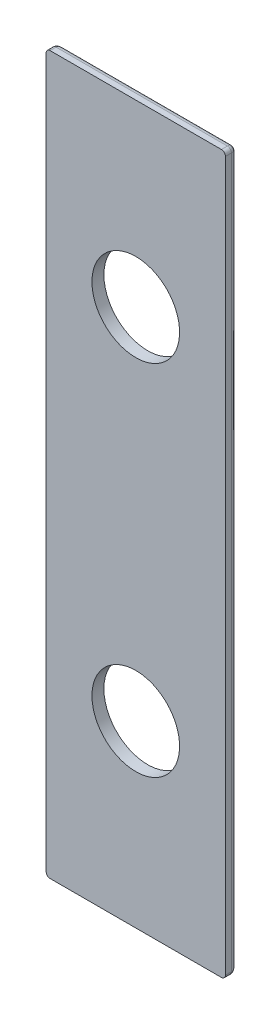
ISO-10303-21;
HEADER;
FILE_DESCRIPTION(('STEP AP214'),'2;1');
FILE_NAME('part.step','',(''),(''),'','','');
FILE_SCHEMA(('AUTOMOTIVE_DESIGN { 1 0 10303 214 1 1 1 1 }'));
ENDSEC;
DATA;
#1=APPLICATION_CONTEXT('core data for automotive mechanical design processes');
#2=APPLICATION_PROTOCOL_DEFINITION('international standard','automotive_design',2000,#1);
#3=PRODUCT_CONTEXT('',#1,'mechanical');
#4=PRODUCT('Part','Part','',(#3));
#5=PRODUCT_RELATED_PRODUCT_CATEGORY('part','',(#4));
#6=PRODUCT_DEFINITION_FORMATION('','',#4);
#7=PRODUCT_DEFINITION_CONTEXT('part definition',#1,'design');
#8=PRODUCT_DEFINITION('design','',#6,#7);
#9=PRODUCT_DEFINITION_SHAPE('','',#8);
#10=(LENGTH_UNIT() NAMED_UNIT(*) SI_UNIT(.MILLI.,.METRE.));
#11=(NAMED_UNIT(*) PLANE_ANGLE_UNIT() SI_UNIT($,.RADIAN.));
#12=(NAMED_UNIT(*) SI_UNIT($,.STERADIAN.) SOLID_ANGLE_UNIT());
#13=UNCERTAINTY_MEASURE_WITH_UNIT(LENGTH_MEASURE(1.E-05),#10,'distance_accuracy_value','');
#14=(GEOMETRIC_REPRESENTATION_CONTEXT(3) GLOBAL_UNCERTAINTY_ASSIGNED_CONTEXT((#13)) GLOBAL_UNIT_ASSIGNED_CONTEXT((#10,
#11,#12)) REPRESENTATION_CONTEXT('',''));
#15=CARTESIAN_POINT('',(0.,0.,0.));
#16=DIRECTION('',(0.,0.,1.));
#17=DIRECTION('',(1.,0.,0.));
#18=AXIS2_PLACEMENT_3D('',#15,#16,#17);
#19=CARTESIAN_POINT('',(21.5,-90.,1.5));
#20=CARTESIAN_POINT('',(21.6495996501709,-90.,1.5));
#21=CARTESIAN_POINT('',(21.8738175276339,-89.9486359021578,1.5));
#22=CARTESIAN_POINT('',(22.128698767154,-89.788318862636,1.5));
#23=CARTESIAN_POINT('',(22.3150612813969,-89.6021463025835,1.5));
#24=CARTESIAN_POINT('',(22.4618741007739,-89.3365606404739,1.5));
#25=CARTESIAN_POINT('',(22.5,-89.1121997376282,1.5));
#26=CARTESIAN_POINT('',(22.5,-89.,1.5));
#27=CARTESIAN_POINT('',(21.5,-90.,1.3878002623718));
#28=CARTESIAN_POINT('',(21.6495996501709,-90.,1.37658410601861));
#29=CARTESIAN_POINT('',(21.8738175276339,-89.9486359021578,1.36367785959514));
#30=CARTESIAN_POINT('',(22.128698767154,-89.788318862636,1.35659921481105));
#31=CARTESIAN_POINT('',(22.3150612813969,-89.6021463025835,1.35658906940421));
#32=CARTESIAN_POINT('',(22.4618741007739,-89.3365606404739,1.36547389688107));
#33=CARTESIAN_POINT('',(22.5,-89.1121997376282,1.37940644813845));
#34=CARTESIAN_POINT('',(22.5,-89.,1.3878002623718));
#35=CARTESIAN_POINT('',(21.493667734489,-89.9810032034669,1.219526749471));
#36=CARTESIAN_POINT('',(21.6388090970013,-89.9769920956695,1.19181888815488));
#37=CARTESIAN_POINT('',(21.8563490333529,-89.9220037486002,1.15996961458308));
#38=CARTESIAN_POINT('',(22.1051171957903,-89.7621005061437,1.14251311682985));
#39=CARTESIAN_POINT('',(22.2883852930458,-89.5790000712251,1.14248786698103));
#40=CARTESIAN_POINT('',(22.4356014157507,-89.3201946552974,1.16439795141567));
#41=CARTESIAN_POINT('',(22.4779774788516,-89.102519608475,1.19878721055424));
#42=CARTESIAN_POINT('',(22.4810032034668,-88.993667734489,1.21952674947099));
#43=CARTESIAN_POINT('',(21.4625698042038,-89.8877094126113,0.895595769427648));
#44=CARTESIAN_POINT('',(21.5887416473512,-89.8682079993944,0.846186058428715));
#45=CARTESIAN_POINT('',(21.777929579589,-89.8004923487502,0.789964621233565));
#46=CARTESIAN_POINT('',(21.9999211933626,-89.6445412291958,0.759269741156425));
#47=CARTESIAN_POINT('',(22.1687376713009,-89.4758439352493,0.759231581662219));
#48=CARTESIAN_POINT('',(22.3152374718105,-89.246456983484,0.797735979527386));
#49=CARTESIAN_POINT('',(22.3731260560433,-89.0572122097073,0.858603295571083));
#50=CARTESIAN_POINT('',(22.3877094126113,-88.9625698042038,0.895595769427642));
#51=CARTESIAN_POINT('',(21.3892697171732,-89.6678091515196,0.496993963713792));
#52=CARTESIAN_POINT('',(21.4789192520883,-89.623519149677,0.445950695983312));
#53=CARTESIAN_POINT('',(21.6134299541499,-89.5389404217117,0.389505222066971));
#54=CARTESIAN_POINT('',(21.7810385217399,-89.3980404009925,0.359032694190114));
#55=CARTESIAN_POINT('',(21.917580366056,-89.2615383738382,0.359011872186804));
#56=CARTESIAN_POINT('',(22.0546353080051,-89.0910155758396,0.397175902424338));
#57=CARTESIAN_POINT('',(22.1346752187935,-88.9565306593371,0.458745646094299));
#58=CARTESIAN_POINT('',(22.1678091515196,-88.8892697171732,0.49699396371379));
#59=CARTESIAN_POINT('',(21.224368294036,-89.1731048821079,0.10246851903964));
#60=CARTESIAN_POINT('',(21.2669560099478,-89.130154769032,0.088465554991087));
#61=CARTESIAN_POINT('',(21.3308756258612,-89.0659334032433,0.073741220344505));
#62=CARTESIAN_POINT('',(21.4162264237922,-88.9803112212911,0.065952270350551));
#63=CARTESIAN_POINT('',(21.4910125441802,-88.9055420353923,0.065954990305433));
#64=CARTESIAN_POINT('',(21.5766541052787,-88.8202186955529,0.075680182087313));
#65=CARTESIAN_POINT('',(21.6409618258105,-88.7563271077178,0.091957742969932));
#66=CARTESIAN_POINT('',(21.6731048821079,-88.724368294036,0.102468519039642));
#67=CARTESIAN_POINT('',(21.0747998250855,-88.7243994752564,0.));
#68=CARTESIAN_POINT('',(21.089047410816,-88.7101518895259,0.));
#69=CARTESIAN_POINT('',(21.1104187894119,-88.68878051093,0.));
#70=CARTESIAN_POINT('',(21.138913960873,-88.6602853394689,0.));
#71=CARTESIAN_POINT('',(21.1638472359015,-88.6353520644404,0.));
#72=CARTESIAN_POINT('',(21.1923424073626,-88.6068568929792,0.));
#73=CARTESIAN_POINT('',(21.2137137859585,-88.5854855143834,0.));
#74=CARTESIAN_POINT('',(21.2243994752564,-88.5747998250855,0.));
#75=CARTESIAN_POINT('',(21.,-88.5,0.));
#76=CARTESIAN_POINT('',(21.,-88.5,0.));
#77=CARTESIAN_POINT('',(21.,-88.5,0.));
#78=CARTESIAN_POINT('',(21.,-88.5,0.));
#79=CARTESIAN_POINT('',(21.,-88.5,0.));
#80=CARTESIAN_POINT('',(21.,-88.5,0.));
#81=CARTESIAN_POINT('',(21.,-88.5,0.));
#82=CARTESIAN_POINT('',(21.,-88.5,0.));
#83=B_SPLINE_SURFACE_WITH_KNOTS('',3,3,((#19,#20,#21,#22,#23,#24,#25,#26),(#27,#28,#29,#30,#31,
#32,#33,#34),(#35,#36,#37,#38,#39,#40,#41,#42),(#43,#44,#45,#46,#47,#48,#49,#50),(#51,#52,#53,
#54,#55,#56,#57,#58),(#59,#60,#61,#62,#63,#64,#65,#66),(#67,#68,#69,#70,#71,#72,#73,#74),(#75,
#76,#77,#78,#79,#80,#81,#82)),.UNSPECIFIED.,.F.,.F.,.F.,(4,1,1,1,1,4),(4,1,1,1,1,4),(0.,
0.224399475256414,0.336599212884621,0.673198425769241,1.12199737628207,1.5707963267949),(0.,
0.285714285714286,0.428571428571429,0.571428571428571,0.785714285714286,1.),.UNSPECIFIED.);
#84=CARTESIAN_POINT('',(21.,-88.5,0.));
#85=CARTESIAN_POINT('',(21.2243994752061,-88.5747998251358,0.));
#86=CARTESIAN_POINT('',(21.6731048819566,-88.7243682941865,0.102468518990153));
#87=CARTESIAN_POINT('',(22.1678091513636,-88.8892697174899,0.4969939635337));
#88=CARTESIAN_POINT('',(22.3877094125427,-88.9625698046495,0.895595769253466));
#89=CARTESIAN_POINT('',(22.4810032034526,-88.9936677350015,1.21952674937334));
#90=CARTESIAN_POINT('',(22.5,-89.0000000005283,1.38780026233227));
#91=CARTESIAN_POINT('',(22.5,-89.0000000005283,1.5));
#92=B_SPLINE_CURVE_WITH_KNOTS('',3,(#84,#85,#86,#87,#88,#89,#90,#91),.UNSPECIFIED.,.F.,.F.,(4,1,
1,1,1,4),(0.,0.448798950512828,0.897597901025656,1.23419711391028,1.34639685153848,
1.5707963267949),.UNSPECIFIED.);
#93=CARTESIAN_POINT('',(22.5,-89.0000000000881,1.5));
#94=VERTEX_POINT('',#93);
#95=CARTESIAN_POINT('',(21.,-88.5,0.));
#96=VERTEX_POINT('',#95);
#97=EDGE_CURVE('E114',#94,#96,#92,.F.);
#98=CARTESIAN_POINT('',(22.5,-89.,1.5));
#99=CARTESIAN_POINT('',(22.5,-89.1121997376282,1.5));
#100=CARTESIAN_POINT('',(22.4618741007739,-89.3365606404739,1.5));
#101=CARTESIAN_POINT('',(22.3150612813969,-89.6021463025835,1.5));
#102=CARTESIAN_POINT('',(22.128698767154,-89.788318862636,1.5));
#103=CARTESIAN_POINT('',(21.8738175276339,-89.9486359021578,1.5));
#104=CARTESIAN_POINT('',(21.6495996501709,-90.,1.5));
#105=CARTESIAN_POINT('',(21.5,-90.,1.5));
#106=B_SPLINE_CURVE_WITH_KNOTS('',3,(#98,#99,#100,#101,#102,#103,#104,#105),.UNSPECIFIED.,.F.,
.F.,(4,1,1,1,1,4),(0.,0.214285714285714,0.428571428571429,0.571428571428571,0.714285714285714,
1.),.UNSPECIFIED.);
#107=CARTESIAN_POINT('',(21.5,-90.,1.5));
#108=VERTEX_POINT('',#107);
#109=EDGE_CURVE('E97',#94,#108,#106,.T.);
#110=CARTESIAN_POINT('',(21.5,-90.,1.5));
#111=CARTESIAN_POINT('',(21.5000000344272,-90.0000001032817,1.48036481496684));
#112=CARTESIAN_POINT('',(21.4998707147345,-89.9996121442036,1.4607297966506));
#113=CARTESIAN_POINT('',(21.499354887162,-89.998064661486,1.42149068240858));
#114=CARTESIAN_POINT('',(21.4989683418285,-89.9969050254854,1.40188659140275));
#115=CARTESIAN_POINT('',(21.4979394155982,-89.9938182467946,1.3627392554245));
#116=CARTESIAN_POINT('',(21.4972969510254,-89.9918908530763,1.34319603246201));
#117=CARTESIAN_POINT('',(21.4957575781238,-89.9872727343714,1.30420023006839));
#118=CARTESIAN_POINT('',(21.494860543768,-89.984581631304,1.28474770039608));
#119=CARTESIAN_POINT('',(21.4928134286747,-89.9784402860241,1.2459630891));
#120=CARTESIAN_POINT('',(21.4916631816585,-89.9749895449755,1.22663109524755));
#121=CARTESIAN_POINT('',(21.4891109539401,-89.9673328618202,1.18811739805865));
#122=CARTESIAN_POINT('',(21.4877087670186,-89.9631263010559,1.1689358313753));
#123=CARTESIAN_POINT('',(21.4846543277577,-89.953962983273,1.13075268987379));
#124=CARTESIAN_POINT('',(21.4830018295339,-89.9490054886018,1.11175131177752));
#125=CARTESIAN_POINT('',(21.4794494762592,-89.9383484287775,1.07395747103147));
#126=CARTESIAN_POINT('',(21.4775493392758,-89.9326480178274,1.05516527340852));
#127=CARTESIAN_POINT('',(21.4735040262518,-89.9205120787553,1.0178190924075));
#128=CARTESIAN_POINT('',(21.4713585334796,-89.9140756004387,0.9992654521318));
#129=CARTESIAN_POINT('',(21.4668259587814,-89.9004778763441,0.962424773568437));
#130=CARTESIAN_POINT('',(21.4644385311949,-89.8933155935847,0.944138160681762));
#131=CARTESIAN_POINT('',(21.4594269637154,-89.8782808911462,0.907858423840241));
#132=CARTESIAN_POINT('',(21.4568024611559,-89.8704073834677,0.889865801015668));
#133=CARTESIAN_POINT('',(21.451321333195,-89.8539639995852,0.854201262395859));
#134=CARTESIAN_POINT('',(21.4484643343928,-89.8453930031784,0.836529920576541));
#135=CARTESIAN_POINT('',(21.4425228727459,-89.8275686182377,0.801535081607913));
#136=CARTESIAN_POINT('',(21.4394380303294,-89.8183140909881,0.784212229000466));
#137=CARTESIAN_POINT('',(21.4330455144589,-89.7991365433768,0.749941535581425));
#138=CARTESIAN_POINT('',(21.4297374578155,-89.7892123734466,0.732994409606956));
#139=CARTESIAN_POINT('',(21.4229031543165,-89.7687094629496,0.699502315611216));
#140=CARTESIAN_POINT('',(21.4193765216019,-89.7581295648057,0.682958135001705));
#141=CARTESIAN_POINT('',(21.4121096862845,-89.7363290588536,0.650299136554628));
#142=CARTESIAN_POINT('',(21.4083690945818,-89.7251072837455,0.634185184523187));
#143=CARTESIAN_POINT('',(21.4006790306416,-89.7020370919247,0.602413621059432));
#144=CARTESIAN_POINT('',(21.3967291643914,-89.6901874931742,0.586756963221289));
#145=CARTESIAN_POINT('',(21.3886250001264,-89.6658750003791,0.555927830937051));
#146=CARTESIAN_POINT('',(21.3844703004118,-89.6534109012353,0.540756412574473));
#147=CARTESIAN_POINT('',(21.3759640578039,-89.6278921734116,0.510917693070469));
#148=CARTESIAN_POINT('',(21.3716121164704,-89.6148363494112,0.496251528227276));
#149=CARTESIAN_POINT('',(21.3627193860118,-89.5881581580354,0.467441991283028));
#150=CARTESIAN_POINT('',(21.3581782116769,-89.5745346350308,0.453299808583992));
#151=CARTESIAN_POINT('',(21.3489148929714,-89.5467446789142,0.425557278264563));
#152=CARTESIAN_POINT('',(21.3441923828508,-89.5325771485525,0.411958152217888));
#153=CARTESIAN_POINT('',(21.334574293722,-89.5037228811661,0.385320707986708));
#154=CARTESIAN_POINT('',(21.3296783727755,-89.4890351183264,0.372283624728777));
#155=CARTESIAN_POINT('',(21.319721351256,-89.4591640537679,0.346789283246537));
#156=CARTESIAN_POINT('',(21.3146599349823,-89.4439798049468,0.334333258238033));
#157=CARTESIAN_POINT('',(21.3043798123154,-89.4131394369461,0.310020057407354));
#158=CARTESIAN_POINT('',(21.2991608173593,-89.3974824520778,0.298164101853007));
#159=CARTESIAN_POINT('',(21.2885734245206,-89.3657202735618,0.275070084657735));
#160=CARTESIAN_POINT('',(21.2832047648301,-89.3496142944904,0.263833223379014));
#161=CARTESIAN_POINT('',(21.2723259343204,-89.3169778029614,0.241996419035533));
#162=CARTESIAN_POINT('',(21.2668155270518,-89.3004465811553,0.231397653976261));
#163=CARTESIAN_POINT('',(21.2556610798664,-89.2669832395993,0.210856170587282));
#164=CARTESIAN_POINT('',(21.2500168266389,-89.2500504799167,0.200914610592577));
#165=CARTESIAN_POINT('',(21.2386026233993,-89.215807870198,0.181706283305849));
#166=CARTESIAN_POINT('',(21.2328324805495,-89.1984974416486,0.172440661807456));
#167=CARTESIAN_POINT('',(21.2211742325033,-89.1635226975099,0.154604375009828));
#168=CARTESIAN_POINT('',(21.2152859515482,-89.1458578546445,0.146034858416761));
#169=CARTESIAN_POINT('',(21.2034002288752,-89.1102006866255,0.129604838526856));
#170=CARTESIAN_POINT('',(21.1974026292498,-89.0922078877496,0.121745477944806));
#171=CARTESIAN_POINT('',(21.1853083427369,-89.0559250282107,0.106741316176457));
#172=CARTESIAN_POINT('',(21.1792115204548,-89.0376345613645,0.0995976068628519));
#173=CARTESIAN_POINT('',(21.1669286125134,-89.0007858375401,0.086032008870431));
#174=CARTESIAN_POINT('',(21.1607424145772,-88.9822272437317,0.079611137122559));
#175=CARTESIAN_POINT('',(21.1482906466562,-88.9448719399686,0.0674980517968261));
#176=CARTESIAN_POINT('',(21.1420249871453,-88.9260749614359,0.0618067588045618));
#177=CARTESIAN_POINT('',(21.129424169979,-88.888272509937,0.0511598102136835));
#178=CARTESIAN_POINT('',(21.1230889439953,-88.869266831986,0.0462049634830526));
#179=CARTESIAN_POINT('',(21.1103588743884,-88.8310766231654,0.0370378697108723));
#180=CARTESIAN_POINT('',(21.1039639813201,-88.8118919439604,0.0328263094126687));
#181=CARTESIAN_POINT('',(21.0911244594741,-88.7733733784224,0.0251527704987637));
#182=CARTESIAN_POINT('',(21.0846797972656,-88.7540393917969,0.0216913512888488));
#183=CARTESIAN_POINT('',(21.071750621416,-88.715251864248,0.015525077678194));
#184=CARTESIAN_POINT('',(21.0652660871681,-88.6957982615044,0.0128206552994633));
#185=CARTESIAN_POINT('',(21.0522670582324,-88.6568011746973,0.00817536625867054));
#186=CARTESIAN_POINT('',(21.0457525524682,-88.6372576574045,0.00623480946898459));
#187=CARTESIAN_POINT('',(21.032703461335,-88.5981103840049,0.00312421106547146));
#188=CARTESIAN_POINT('',(21.0261688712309,-88.5785066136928,0.00195436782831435));
#189=CARTESIAN_POINT('',(21.0130895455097,-88.5392686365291,0.00039224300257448));
#190=CARTESIAN_POINT('',(21.0065448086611,-88.5196344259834,6.46256730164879E-08));
#191=CARTESIAN_POINT('',(21.,-88.5,0.));
#192=B_SPLINE_CURVE_WITH_KNOTS('',3,(#110,#111,#112,#113,#114,#115,#116,#117,#118,#119,#120,
#121,#122,#123,#124,#125,#126,#127,#128,#129,#130,#131,#132,#133,#134,#135,#136,#137,#138,#139,
#140,#141,#142,#143,#144,#145,#146,#147,#148,#149,#150,#151,#152,#153,#154,#155,#156,#157,#158,
#159,#160,#161,#162,#163,#164,#165,#166,#167,#168,#169,#170,#171,#172,#173,#174,#175,#176,#177,
#178,#179,#180,#181,#182,#183,#184,#185,#186,#187,#188,#189,#190,#191),.UNSPECIFIED.,.F.,.F.,(4,
2,2,2,2,2,2,2,2,2,2,2,2,2,2,2,2,2,2,2,2,2,2,2,2,2,2,2,2,2,2,2,2,2,2,2,2,2,2,2,4),(0.,
0.0589010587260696,0.117810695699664,0.17673960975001,0.235697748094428,0.294694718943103,
0.353740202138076,0.412844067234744,0.472015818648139,0.531264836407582,0.590599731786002,
0.650026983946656,0.709551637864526,0.769177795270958,0.828909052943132,0.888748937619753,
0.948701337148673,1.0087709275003,1.06896340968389,1.12928343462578,1.18973290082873,
1.25031145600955,1.31101695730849,1.37184592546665,1.43279399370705,1.49385635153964,
1.55502818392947,1.61630510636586,1.67768359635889,1.73916139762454,1.80073642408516,
1.86240400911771,1.92415729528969,1.98598775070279,2.04788562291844,2.10984038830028,
2.1718411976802,2.23387731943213,2.29593858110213,2.35801581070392,2.42010127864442),.UNSPECIFIED.);
#193=EDGE_CURVE('E118',#96,#108,#192,.F.);
#194=ORIENTED_EDGE('',*,*,#97,.F.);
#195=ORIENTED_EDGE('',*,*,#109,.T.);
#196=ORIENTED_EDGE('',*,*,#193,.F.);
#197=EDGE_LOOP('',(#194,#195,#196));
#198=FACE_BOUND('',#197,.T.);
#199=ADVANCED_FACE('F16',(#198),#83,.T.);
#200=CARTESIAN_POINT('',(22.5,89.,1.5));
#201=CARTESIAN_POINT('',(22.5,89.1495996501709,1.5));
#202=CARTESIAN_POINT('',(22.4486359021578,89.373817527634,1.5));
#203=CARTESIAN_POINT('',(22.288318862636,89.628698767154,1.5));
#204=CARTESIAN_POINT('',(22.1021463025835,89.815061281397,1.5));
#205=CARTESIAN_POINT('',(21.8365606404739,89.9618741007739,1.5));
#206=CARTESIAN_POINT('',(21.6121997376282,90.,1.5));
#207=CARTESIAN_POINT('',(21.5,90.,1.5));
#208=CARTESIAN_POINT('',(22.5,89.,1.38780026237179));
#209=CARTESIAN_POINT('',(22.5,89.1495996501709,1.3765841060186));
#210=CARTESIAN_POINT('',(22.4486359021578,89.373817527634,1.36367785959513));
#211=CARTESIAN_POINT('',(22.288318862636,89.628698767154,1.35659921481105));
#212=CARTESIAN_POINT('',(22.1021463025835,89.815061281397,1.3565890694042));
#213=CARTESIAN_POINT('',(21.8365606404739,89.9618741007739,1.36547389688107));
#214=CARTESIAN_POINT('',(21.6121997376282,90.,1.37940644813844));
#215=CARTESIAN_POINT('',(21.5,90.,1.38780026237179));
#216=CARTESIAN_POINT('',(22.4747625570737,88.9915875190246,1.16338542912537));
#217=CARTESIAN_POINT('',(22.4692834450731,89.1351526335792,1.12989688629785));
#218=CARTESIAN_POINT('',(22.4129448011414,89.3503381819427,1.09139862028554));
#219=CARTESIAN_POINT('',(22.2530897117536,89.5969880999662,1.07029653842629));
#220=CARTESIAN_POINT('',(22.0710158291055,89.7792239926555,1.07026603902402));
#221=CARTESIAN_POINT('',(21.8145715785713,89.9266853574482,1.09675187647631));
#222=CARTESIAN_POINT('',(21.5992585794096,89.9706398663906,1.13831950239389));
#223=CARTESIAN_POINT('',(21.4915875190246,89.9747625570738,1.16338542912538));
#224=CARTESIAN_POINT('',(22.3628176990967,88.9542725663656,0.843755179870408));
#225=CARTESIAN_POINT('',(22.3396559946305,89.0757403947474,0.793168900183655));
#226=CARTESIAN_POINT('',(22.2691014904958,89.2578905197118,0.735815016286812));
#227=CARTESIAN_POINT('',(22.1144742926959,89.4731021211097,0.704545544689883));
#228=CARTESIAN_POINT('',(21.9495620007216,89.6381215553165,0.704508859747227));
#229=CARTESIAN_POINT('',(21.7275819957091,89.7840738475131,0.74372626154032));
#230=CARTESIAN_POINT('',(21.5453891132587,89.8454967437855,0.805877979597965));
#231=CARTESIAN_POINT('',(21.4542725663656,89.8628176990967,0.843755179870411));
#232=CARTESIAN_POINT('',(22.1227698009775,88.8742566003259,0.461143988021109));
#233=CARTESIAN_POINT('',(22.0786617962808,88.9596853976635,0.413712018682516));
#234=CARTESIAN_POINT('',(21.9960466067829,89.0878670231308,0.361347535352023));
#235=CARTESIAN_POINT('',(21.8602333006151,89.2480479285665,0.33309656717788));
#236=CARTESIAN_POINT('',(21.7293501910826,89.3789711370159,0.333078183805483));
#237=CARTESIAN_POINT('',(21.5665071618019,89.5112733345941,0.368456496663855));
#238=CARTESIAN_POINT('',(21.4383528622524,89.5897766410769,0.425599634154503));
#239=CARTESIAN_POINT('',(21.3742566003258,89.6227698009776,0.461143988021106));
#240=CARTESIAN_POINT('',(21.6731499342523,88.7243833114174,0.10246319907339));
#241=CARTESIAN_POINT('',(21.6301561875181,88.766924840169,0.088219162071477));
#242=CARTESIAN_POINT('',(21.5658590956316,88.830777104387,0.073201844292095));
#243=CARTESIAN_POINT('',(21.480183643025,88.9160923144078,0.065249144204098));
#244=CARTESIAN_POINT('',(21.4054065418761,88.9908860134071,0.065251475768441));
#245=CARTESIAN_POINT('',(21.3201307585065,89.0765927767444,0.075182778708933));
#246=CARTESIAN_POINT('',(21.2563079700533,89.1409756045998,0.091772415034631));
#247=CARTESIAN_POINT('',(21.2243833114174,89.1731499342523,0.102463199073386));
#248=CARTESIAN_POINT('',(21.2243994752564,88.5747998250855,0.));
#249=CARTESIAN_POINT('',(21.2101518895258,88.589047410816,0.));
#250=CARTESIAN_POINT('',(21.18878051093,88.6104187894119,0.));
#251=CARTESIAN_POINT('',(21.1602853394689,88.638913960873,0.));
#252=CARTESIAN_POINT('',(21.1353520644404,88.6638472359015,0.));
#253=CARTESIAN_POINT('',(21.1068568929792,88.6923424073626,0.));
#254=CARTESIAN_POINT('',(21.0854855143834,88.7137137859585,0.));
#255=CARTESIAN_POINT('',(21.0747998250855,88.7243994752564,0.));
#256=CARTESIAN_POINT('',(21.,88.5,0.));
#257=CARTESIAN_POINT('',(21.,88.5,0.));
#258=CARTESIAN_POINT('',(21.,88.5,0.));
#259=CARTESIAN_POINT('',(21.,88.5,0.));
#260=CARTESIAN_POINT('',(21.,88.5000000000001,0.));
#261=CARTESIAN_POINT('',(21.,88.5,0.));
#262=CARTESIAN_POINT('',(21.,88.5,0.));
#263=CARTESIAN_POINT('',(21.,88.5,0.));
#264=B_SPLINE_SURFACE_WITH_KNOTS('',3,3,((#200,#201,#202,#203,#204,#205,#206,#207),(#208,#209,
#210,#211,#212,#213,#214,#215),(#216,#217,#218,#219,#220,#221,#222,#223),(#224,#225,#226,#227,
#228,#229,#230,#231),(#232,#233,#234,#235,#236,#237,#238,#239),(#240,#241,#242,#243,#244,#245,
#246,#247),(#248,#249,#250,#251,#252,#253,#254,#255),(#256,#257,#258,#259,#260,#261,#262,#263)),
.UNSPECIFIED.,.F.,.F.,.F.,(4,1,1,1,1,4),(4,1,1,1,1,4),(0.,0.224399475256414,0.448798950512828,
0.673198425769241,1.12199737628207,1.5707963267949),(0.,0.285714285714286,0.428571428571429,
0.571428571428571,0.785714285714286,1.),.UNSPECIFIED.);
#265=CARTESIAN_POINT('',(21.,88.5,0.));
#266=CARTESIAN_POINT('',(21.0747998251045,88.7243994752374,0.));
#267=CARTESIAN_POINT('',(21.2243833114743,89.173149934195,0.102463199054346));
#268=CARTESIAN_POINT('',(21.37425660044,89.6227698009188,0.461143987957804));
#269=CARTESIAN_POINT('',(21.4542725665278,89.8628176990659,0.843755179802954));
#270=CARTESIAN_POINT('',(21.4915875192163,89.9747625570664,1.16338542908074));
#271=CARTESIAN_POINT('',(21.5000000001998,90.,1.38780026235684));
#272=CARTESIAN_POINT('',(21.5000000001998,90.,1.5));
#273=B_SPLINE_CURVE_WITH_KNOTS('',3,(#265,#266,#267,#268,#269,#270,#271,#272),.UNSPECIFIED.,.F.,
.F.,(4,1,1,1,1,4),(0.,0.448798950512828,0.897597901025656,1.12199737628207,1.34639685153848,
1.5707963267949),.UNSPECIFIED.);
#274=CARTESIAN_POINT('',(21.5000000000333,90.,1.5));
#275=VERTEX_POINT('',#274);
#276=CARTESIAN_POINT('',(21.,88.5,0.));
#277=VERTEX_POINT('',#276);
#278=EDGE_CURVE('E226',#275,#277,#273,.F.);
#279=CARTESIAN_POINT('',(21.5,90.,1.5));
#280=CARTESIAN_POINT('',(21.6121997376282,90.,1.5));
#281=CARTESIAN_POINT('',(21.8365606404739,89.9618741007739,1.5));
#282=CARTESIAN_POINT('',(22.1021463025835,89.815061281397,1.5));
#283=CARTESIAN_POINT('',(22.288318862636,89.628698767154,1.5));
#284=CARTESIAN_POINT('',(22.4486359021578,89.373817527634,1.5));
#285=CARTESIAN_POINT('',(22.5,89.1495996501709,1.5));
#286=CARTESIAN_POINT('',(22.5,89.,1.5));
#287=B_SPLINE_CURVE_WITH_KNOTS('',3,(#279,#280,#281,#282,#283,#284,#285,#286),.UNSPECIFIED.,.F.,
.F.,(4,1,1,1,1,4),(0.,0.214285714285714,0.428571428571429,0.571428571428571,0.714285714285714,
1.),.UNSPECIFIED.);
#288=CARTESIAN_POINT('',(22.5,89.,1.5));
#289=VERTEX_POINT('',#288);
#290=EDGE_CURVE('E110',#275,#289,#287,.T.);
#291=CARTESIAN_POINT('',(22.5,89.,1.5));
#292=CARTESIAN_POINT('',(22.5000000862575,89.0000000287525,1.4803642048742));
#293=CARTESIAN_POINT('',(22.4996135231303,88.9998711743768,1.46072852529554));
#294=CARTESIAN_POINT('',(22.4980705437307,88.9993568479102,1.42148712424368));
#295=CARTESIAN_POINT('',(22.4969139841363,88.9989713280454,1.40188140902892));
#296=CARTESIAN_POINT('',(22.4938339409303,88.9979446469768,1.36273040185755));
#297=CARTESIAN_POINT('',(22.4919101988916,88.9973033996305,1.34318513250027));
#298=CARTESIAN_POINT('',(22.4872987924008,88.9957662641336,1.30418540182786));
#299=CARTESIAN_POINT('',(22.484610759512,88.9948702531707,1.28473098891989));
#300=CARTESIAN_POINT('',(22.4784739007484,88.9928246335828,1.24594333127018));
#301=CARTESIAN_POINT('',(22.4750245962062,88.9916748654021,1.22661017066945));
#302=CARTESIAN_POINT('',(22.4673677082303,88.9891225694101,1.18809549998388));
#303=CARTESIAN_POINT('',(22.4631595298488,88.9877198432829,1.16891412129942));
#304=CARTESIAN_POINT('',(22.4539899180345,88.9846633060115,1.13073287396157));
#305=CARTESIAN_POINT('',(22.4490277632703,88.9830092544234,1.11173319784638));
#306=CARTESIAN_POINT('',(22.438361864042,88.9794539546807,1.0739431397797));
#307=CARTESIAN_POINT('',(22.4326572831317,88.9775524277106,1.05515302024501));
#308=CARTESIAN_POINT('',(22.4205171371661,88.9735057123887,1.01781003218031));
#309=CARTESIAN_POINT('',(22.4140806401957,88.9713602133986,0.999257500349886));
#310=CARTESIAN_POINT('',(22.4004874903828,88.966829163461,0.962417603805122));
#311=CARTESIAN_POINT('',(22.3933298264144,88.9644432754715,0.944130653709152));
#312=CARTESIAN_POINT('',(22.3783052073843,88.9594350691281,0.907849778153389));
#313=CARTESIAN_POINT('',(22.3704371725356,88.9568123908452,0.889856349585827));
#314=CARTESIAN_POINT('',(22.3540022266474,88.9513340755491,0.854190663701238));
#315=CARTESIAN_POINT('',(22.3454341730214,88.9484780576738,0.836518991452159));
#316=CARTESIAN_POINT('',(22.3276123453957,88.9425374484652,0.801524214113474));
#317=CARTESIAN_POINT('',(22.3183573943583,88.9394524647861,0.784201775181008));
#318=CARTESIAN_POINT('',(22.2991768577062,88.9330589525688,0.749932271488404));
#319=CARTESIAN_POINT('',(22.2892500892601,88.9297500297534,0.732985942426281));
#320=CARTESIAN_POINT('',(22.2687406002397,88.9229135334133,0.699495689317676));
#321=CARTESIAN_POINT('',(22.2581566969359,88.9193855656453,0.682952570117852));
#322=CARTESIAN_POINT('',(22.236347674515,88.912115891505,0.650295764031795));
#323=CARTESIAN_POINT('',(22.225121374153,88.9083737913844,0.634182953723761));
#324=CARTESIAN_POINT('',(22.2020424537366,88.9006808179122,0.602413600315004));
#325=CARTESIAN_POINT('',(22.1901886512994,88.8967295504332,0.586758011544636));
#326=CARTESIAN_POINT('',(22.1658689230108,88.8886229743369,0.555930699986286));
#327=CARTESIAN_POINT('',(22.1534018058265,88.8844672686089,0.540760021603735));
#328=CARTESIAN_POINT('',(22.1278781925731,88.8759593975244,0.510922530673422));
#329=CARTESIAN_POINT('',(22.1148205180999,88.8716068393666,0.496256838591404));
#330=CARTESIAN_POINT('',(22.0881396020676,88.8627132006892,0.467448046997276));
#331=CARTESIAN_POINT('',(22.0745152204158,88.8581717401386,0.45330612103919));
#332=CARTESIAN_POINT('',(22.0467243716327,88.8489081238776,0.42556393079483));
#333=CARTESIAN_POINT('',(22.0325568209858,88.8441856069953,0.411964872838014));
#334=CARTESIAN_POINT('',(22.0037031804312,88.8345677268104,0.385327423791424));
#335=CARTESIAN_POINT('',(21.9890160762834,88.8296720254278,0.372290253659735));
#336=CARTESIAN_POINT('',(21.9591468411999,88.8197156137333,0.34679562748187));
#337=CARTESIAN_POINT('',(21.9439637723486,88.8146545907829,0.334339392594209));
#338=CARTESIAN_POINT('',(21.9131261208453,88.8043753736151,0.310025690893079));
#339=CARTESIAN_POINT('',(21.897470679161,88.7991568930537,0.29816943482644));
#340=CARTESIAN_POINT('',(21.8657117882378,88.7885705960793,0.275074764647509));
#341=CARTESIAN_POINT('',(21.8496075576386,88.7832025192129,0.263837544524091));
#342=CARTESIAN_POINT('',(21.8169746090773,88.7723248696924,0.241999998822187));
#343=CARTESIAN_POINT('',(21.8004451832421,88.7668150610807,0.231400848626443));
#344=CARTESIAN_POINT('',(21.7669853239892,88.7556617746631,0.210858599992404));
#345=CARTESIAN_POINT('',(21.7500542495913,88.7500180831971,0.20091666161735));
#346=CARTESIAN_POINT('',(21.7158147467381,88.7386049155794,0.181707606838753));
#347=CARTESIAN_POINT('',(21.6985057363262,88.7328352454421,0.172441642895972));
#348=CARTESIAN_POINT('',(21.6635334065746,88.7211778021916,0.154604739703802));
#349=CARTESIAN_POINT('',(21.6458695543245,88.7152898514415,0.146034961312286));
#350=CARTESIAN_POINT('',(21.6102138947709,88.7034046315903,0.12960449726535));
#351=CARTESIAN_POINT('',(21.5922216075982,88.6974072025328,0.121744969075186));
#352=CARTESIAN_POINT('',(21.5559393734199,88.6853131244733,0.106740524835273));
#353=CARTESIAN_POINT('',(21.5376490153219,88.6792163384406,0.0995967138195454));
#354=CARTESIAN_POINT('',(21.5008001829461,88.6669333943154,0.0860309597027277));
#355=CARTESIAN_POINT('',(21.4822413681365,88.6607471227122,0.0796100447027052));
#356=CARTESIAN_POINT('',(21.4448853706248,88.6482951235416,0.0674969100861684));
#357=CARTESIAN_POINT('',(21.426087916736,88.6420293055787,0.0618056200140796));
#358=CARTESIAN_POINT('',(21.3882843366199,88.6294281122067,0.0511587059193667));
#359=CARTESIAN_POINT('',(21.36927800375,88.6230926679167,0.0462038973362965));
#360=CARTESIAN_POINT('',(21.3310863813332,88.610362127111,0.0370368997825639));
#361=CARTESIAN_POINT('',(21.311900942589,88.603966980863,0.0328254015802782));
#362=CARTESIAN_POINT('',(21.2733808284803,88.5911269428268,0.0251519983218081));
#363=CARTESIAN_POINT('',(21.2540460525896,88.5846820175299,0.0216906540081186));
#364=CARTESIAN_POINT('',(21.2152569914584,88.5717523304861,0.0155245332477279));
#365=CARTESIAN_POINT('',(21.1958026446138,88.5652675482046,0.0128201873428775));
#366=CARTESIAN_POINT('',(21.1568041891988,88.5522680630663,0.00817504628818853));
#367=CARTESIAN_POINT('',(21.1372600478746,88.5457533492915,0.00623455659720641));
#368=CARTESIAN_POINT('',(21.0981117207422,88.5327039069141,0.00312407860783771));
#369=CARTESIAN_POINT('',(21.0785075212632,88.5261691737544,0.00195428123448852));
#370=CARTESIAN_POINT('',(21.03926895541,88.5130896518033,0.000392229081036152));
#371=CARTESIAN_POINT('',(21.0196345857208,88.5065448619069,6.6931341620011E-08));
#372=CARTESIAN_POINT('',(21.,88.5,0.));
#373=B_SPLINE_CURVE_WITH_KNOTS('',3,(#291,#292,#293,#294,#295,#296,#297,#298,#299,#300,#301,
#302,#303,#304,#305,#306,#307,#308,#309,#310,#311,#312,#313,#314,#315,#316,#317,#318,#319,#320,
#321,#322,#323,#324,#325,#326,#327,#328,#329,#330,#331,#332,#333,#334,#335,#336,#337,#338,#339,
#340,#341,#342,#343,#344,#345,#346,#347,#348,#349,#350,#351,#352,#353,#354,#355,#356,#357,#358,
#359,#360,#361,#362,#363,#364,#365,#366,#367,#368,#369,#370,#371,#372),.UNSPECIFIED.,.F.,.F.,(4,
2,2,2,2,2,2,2,2,2,2,2,2,2,2,2,2,2,2,2,2,2,2,2,2,2,2,2,2,2,2,2,2,2,2,2,2,2,2,2,4),(0.,
0.0589029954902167,0.117816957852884,0.176750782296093,0.235713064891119,0.294712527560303,
0.353758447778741,0.412861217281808,0.472031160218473,0.531277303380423,0.590607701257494,
0.650029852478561,0.709551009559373,0.769176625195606,0.828910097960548,0.888754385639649,
0.948712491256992,1.00878790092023,1.06898500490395,1.12930803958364,1.1897589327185,
1.25033742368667,1.31104151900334,1.37186794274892,1.43281258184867,1.49387092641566,
1.55503850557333,1.61631131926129,1.67768626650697,1.73916153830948,1.80073525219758,
1.8624026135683,1.92415659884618,1.98598849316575,2.04788834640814,2.10984542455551,
2.17184865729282,2.23388708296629,2.29595029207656,2.35802887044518,2.42011484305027),.UNSPECIFIED.);
#374=EDGE_CURVE('E126',#277,#289,#373,.F.);
#375=ORIENTED_EDGE('',*,*,#278,.F.);
#376=ORIENTED_EDGE('',*,*,#290,.T.);
#377=ORIENTED_EDGE('',*,*,#374,.F.);
#378=EDGE_LOOP('',(#375,#376,#377));
#379=FACE_BOUND('',#378,.T.);
#380=ADVANCED_FACE('F331',(#379),#264,.T.);
#381=CARTESIAN_POINT('',(-21.5,90.,1.5));
#382=CARTESIAN_POINT('',(-21.6495996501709,90.,1.5));
#383=CARTESIAN_POINT('',(-21.8738175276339,89.9486359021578,1.5));
#384=CARTESIAN_POINT('',(-22.128698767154,89.788318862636,1.5));
#385=CARTESIAN_POINT('',(-22.3150612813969,89.6021463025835,1.5));
#386=CARTESIAN_POINT('',(-22.4618741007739,89.3365606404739,1.5));
#387=CARTESIAN_POINT('',(-22.5,89.1121997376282,1.5));
#388=CARTESIAN_POINT('',(-22.5,89.,1.5));
#389=CARTESIAN_POINT('',(-21.5,90.,1.3878002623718));
#390=CARTESIAN_POINT('',(-21.6495996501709,90.,1.37658410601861));
#391=CARTESIAN_POINT('',(-21.8738175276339,89.9486359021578,1.36367785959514));
#392=CARTESIAN_POINT('',(-22.128698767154,89.788318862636,1.35659921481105));
#393=CARTESIAN_POINT('',(-22.3150612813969,89.6021463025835,1.35658906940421));
#394=CARTESIAN_POINT('',(-22.4618741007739,89.3365606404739,1.36547389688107));
#395=CARTESIAN_POINT('',(-22.5,89.1121997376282,1.37940644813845));
#396=CARTESIAN_POINT('',(-22.5,89.,1.3878002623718));
#397=CARTESIAN_POINT('',(-21.4915875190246,89.9747625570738,1.16338542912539));
#398=CARTESIAN_POINT('',(-21.6351526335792,89.9692834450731,1.12989688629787));
#399=CARTESIAN_POINT('',(-21.8503381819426,89.9129448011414,1.09139862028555));
#400=CARTESIAN_POINT('',(-22.0969880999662,89.7530897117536,1.0702965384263));
#401=CARTESIAN_POINT('',(-22.2792239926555,89.5710158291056,1.07026603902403));
#402=CARTESIAN_POINT('',(-22.4266853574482,89.3145715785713,1.09675187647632));
#403=CARTESIAN_POINT('',(-22.4706398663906,89.0992585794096,1.1383195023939));
#404=CARTESIAN_POINT('',(-22.4747625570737,88.9915875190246,1.16338542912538));
#405=CARTESIAN_POINT('',(-21.4542725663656,89.8628176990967,0.843755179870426));
#406=CARTESIAN_POINT('',(-21.5757403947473,89.8396559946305,0.793168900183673));
#407=CARTESIAN_POINT('',(-21.7578905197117,89.7691014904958,0.735815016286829));
#408=CARTESIAN_POINT('',(-21.9731021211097,89.6144742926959,0.7045455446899));
#409=CARTESIAN_POINT('',(-22.1381215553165,89.4495620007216,0.704508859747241));
#410=CARTESIAN_POINT('',(-22.2840738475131,89.2275819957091,0.743726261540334));
#411=CARTESIAN_POINT('',(-22.3454967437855,89.0453891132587,0.805877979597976));
#412=CARTESIAN_POINT('',(-22.3628176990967,88.9542725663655,0.843755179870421));
#413=CARTESIAN_POINT('',(-21.3742566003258,89.6227698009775,0.461143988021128));
#414=CARTESIAN_POINT('',(-21.4596853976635,89.5786617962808,0.413712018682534));
#415=CARTESIAN_POINT('',(-21.5878670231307,89.4960466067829,0.36134753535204));
#416=CARTESIAN_POINT('',(-21.7480479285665,89.3602333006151,0.333096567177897));
#417=CARTESIAN_POINT('',(-21.8789711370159,89.2293501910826,0.3330781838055));
#418=CARTESIAN_POINT('',(-22.0112733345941,89.0665071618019,0.368456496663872));
#419=CARTESIAN_POINT('',(-22.0897766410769,88.9383528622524,0.425599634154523));
#420=CARTESIAN_POINT('',(-22.1227698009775,88.8742566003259,0.461143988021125));
#421=CARTESIAN_POINT('',(-21.2243833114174,89.1731499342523,0.102463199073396));
#422=CARTESIAN_POINT('',(-21.266924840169,89.1301561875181,0.088219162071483));
#423=CARTESIAN_POINT('',(-21.330777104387,89.0658590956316,0.073201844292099));
#424=CARTESIAN_POINT('',(-21.4160923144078,88.980183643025,0.065249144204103));
#425=CARTESIAN_POINT('',(-21.4908860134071,88.9054065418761,0.065251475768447));
#426=CARTESIAN_POINT('',(-21.5765927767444,88.8201307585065,0.075182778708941));
#427=CARTESIAN_POINT('',(-21.6409756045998,88.7563079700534,0.091772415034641));
#428=CARTESIAN_POINT('',(-21.6731499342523,88.7243833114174,0.102463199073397));
#429=CARTESIAN_POINT('',(-21.0747998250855,88.7243994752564,0.));
#430=CARTESIAN_POINT('',(-21.089047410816,88.7101518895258,0.));
#431=CARTESIAN_POINT('',(-21.1104187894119,88.68878051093,0.));
#432=CARTESIAN_POINT('',(-21.138913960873,88.6602853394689,0.));
#433=CARTESIAN_POINT('',(-21.1638472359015,88.6353520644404,0.));
#434=CARTESIAN_POINT('',(-21.1923424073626,88.6068568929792,0.));
#435=CARTESIAN_POINT('',(-21.2137137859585,88.5854855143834,0.));
#436=CARTESIAN_POINT('',(-21.2243994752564,88.5747998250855,0.));
#437=CARTESIAN_POINT('',(-21.,88.5,0.));
#438=CARTESIAN_POINT('',(-21.,88.5,0.));
#439=CARTESIAN_POINT('',(-21.,88.5,0.));
#440=CARTESIAN_POINT('',(-21.,88.5,0.));
#441=CARTESIAN_POINT('',(-21.,88.5,0.));
#442=CARTESIAN_POINT('',(-21.,88.5,0.));
#443=CARTESIAN_POINT('',(-21.,88.5,0.));
#444=CARTESIAN_POINT('',(-21.,88.5,0.));
#445=B_SPLINE_SURFACE_WITH_KNOTS('',3,3,((#381,#382,#383,#384,#385,#386,#387,#388),(#389,#390,
#391,#392,#393,#394,#395,#396),(#397,#398,#399,#400,#401,#402,#403,#404),(#405,#406,#407,#408,
#409,#410,#411,#412),(#413,#414,#415,#416,#417,#418,#419,#420),(#421,#422,#423,#424,#425,#426,
#427,#428),(#429,#430,#431,#432,#433,#434,#435,#436),(#437,#438,#439,#440,#441,#442,#443,#444)),
.UNSPECIFIED.,.F.,.F.,.F.,(4,1,1,1,1,4),(4,1,1,1,1,4),(0.,0.224399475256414,0.448798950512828,
0.673198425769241,1.12199737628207,1.5707963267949),(0.,0.285714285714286,0.428571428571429,
0.571428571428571,0.785714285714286,1.),.UNSPECIFIED.);
#446=CARTESIAN_POINT('',(-21.,88.5,0.));
#447=CARTESIAN_POINT('',(-21.2243994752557,88.5747998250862,0.));
#448=CARTESIAN_POINT('',(-21.6731499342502,88.7243833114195,0.102463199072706));
#449=CARTESIAN_POINT('',(-22.1227698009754,88.87425660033,0.461143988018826));
#450=CARTESIAN_POINT('',(-22.3628176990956,88.9542725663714,0.843755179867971));
#451=CARTESIAN_POINT('',(-22.4747625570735,88.9915875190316,1.16338542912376));
#452=CARTESIAN_POINT('',(-22.5,89.0000000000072,1.38780026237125));
#453=CARTESIAN_POINT('',(-22.5,89.0000000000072,1.5));
#454=B_SPLINE_CURVE_WITH_KNOTS('',3,(#446,#447,#448,#449,#450,#451,#452,#453),.UNSPECIFIED.,.F.,
.F.,(4,1,1,1,1,4),(0.,0.448798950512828,0.897597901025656,1.12199737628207,1.34639685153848,
1.5707963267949),.UNSPECIFIED.);
#455=CARTESIAN_POINT('',(-22.5,89.,1.5));
#456=VERTEX_POINT('',#455);
#457=CARTESIAN_POINT('',(-21.,88.5,0.));
#458=VERTEX_POINT('',#457);
#459=EDGE_CURVE('E174',#456,#458,#454,.F.);
#460=CARTESIAN_POINT('',(-22.5,89.,1.5));
#461=CARTESIAN_POINT('',(-22.5,89.1121997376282,1.5));
#462=CARTESIAN_POINT('',(-22.4618741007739,89.3365606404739,1.5));
#463=CARTESIAN_POINT('',(-22.3150612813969,89.6021463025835,1.5));
#464=CARTESIAN_POINT('',(-22.128698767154,89.788318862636,1.5));
#465=CARTESIAN_POINT('',(-21.8738175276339,89.9486359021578,1.5));
#466=CARTESIAN_POINT('',(-21.6495996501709,90.,1.5));
#467=CARTESIAN_POINT('',(-21.5,90.,1.5));
#468=B_SPLINE_CURVE_WITH_KNOTS('',3,(#460,#461,#462,#463,#464,#465,#466,#467),.UNSPECIFIED.,.F.,
.F.,(4,1,1,1,1,4),(0.,0.214285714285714,0.428571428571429,0.571428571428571,0.714285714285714,
1.),.UNSPECIFIED.);
#469=CARTESIAN_POINT('',(-21.5,90.,1.5));
#470=VERTEX_POINT('',#469);
#471=EDGE_CURVE('E358',#456,#470,#468,.T.);
#472=CARTESIAN_POINT('',(-21.5,90.,1.5));
#473=CARTESIAN_POINT('',(-21.5000000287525,90.0000000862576,1.4803642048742));
#474=CARTESIAN_POINT('',(-21.4998711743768,89.9996135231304,1.46072852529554));
#475=CARTESIAN_POINT('',(-21.4993568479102,89.9980705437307,1.42148712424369));
#476=CARTESIAN_POINT('',(-21.4989713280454,89.9969139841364,1.40188140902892));
#477=CARTESIAN_POINT('',(-21.4979446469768,89.9938339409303,1.36273040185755));
#478=CARTESIAN_POINT('',(-21.4973033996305,89.9919101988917,1.34318513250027));
#479=CARTESIAN_POINT('',(-21.4957662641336,89.9872987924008,1.30418540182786));
#480=CARTESIAN_POINT('',(-21.4948702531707,89.984610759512,1.2847309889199));
#481=CARTESIAN_POINT('',(-21.4928246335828,89.9784739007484,1.24594333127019));
#482=CARTESIAN_POINT('',(-21.4916748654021,89.9750245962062,1.22661017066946));
#483=CARTESIAN_POINT('',(-21.4891225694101,89.9673677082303,1.18809549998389));
#484=CARTESIAN_POINT('',(-21.4877198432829,89.9631595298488,1.16891412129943));
#485=CARTESIAN_POINT('',(-21.4846633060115,89.9539899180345,1.13073287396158));
#486=CARTESIAN_POINT('',(-21.4830092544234,89.9490277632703,1.11173319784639));
#487=CARTESIAN_POINT('',(-21.4794539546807,89.938361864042,1.07394313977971));
#488=CARTESIAN_POINT('',(-21.4775524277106,89.9326572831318,1.05515302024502));
#489=CARTESIAN_POINT('',(-21.4735057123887,89.9205171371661,1.01781003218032));
#490=CARTESIAN_POINT('',(-21.4713602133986,89.9140806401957,0.999257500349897));
#491=CARTESIAN_POINT('',(-21.4668291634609,89.9004874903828,0.962417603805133));
#492=CARTESIAN_POINT('',(-21.4644432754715,89.8933298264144,0.944130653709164));
#493=CARTESIAN_POINT('',(-21.4594350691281,89.8783052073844,0.907849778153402));
#494=CARTESIAN_POINT('',(-21.4568123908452,89.8704371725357,0.889856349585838));
#495=CARTESIAN_POINT('',(-21.4513340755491,89.8540022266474,0.854190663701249));
#496=CARTESIAN_POINT('',(-21.4484780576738,89.8454341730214,0.836518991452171));
#497=CARTESIAN_POINT('',(-21.4425374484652,89.8276123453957,0.801524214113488));
#498=CARTESIAN_POINT('',(-21.4394524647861,89.8183573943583,0.784201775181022));
#499=CARTESIAN_POINT('',(-21.4330589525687,89.7991768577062,0.749932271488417));
#500=CARTESIAN_POINT('',(-21.4297500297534,89.7892500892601,0.732985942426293));
#501=CARTESIAN_POINT('',(-21.4229135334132,89.7687406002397,0.699495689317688));
#502=CARTESIAN_POINT('',(-21.4193855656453,89.7581566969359,0.682952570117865));
#503=CARTESIAN_POINT('',(-21.412115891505,89.736347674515,0.650295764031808));
#504=CARTESIAN_POINT('',(-21.4083737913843,89.725121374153,0.634182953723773));
#505=CARTESIAN_POINT('',(-21.4006808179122,89.7020424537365,0.602413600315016));
#506=CARTESIAN_POINT('',(-21.3967295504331,89.6901886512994,0.586758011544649));
#507=CARTESIAN_POINT('',(-21.3886229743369,89.6658689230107,0.555930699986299));
#508=CARTESIAN_POINT('',(-21.3844672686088,89.6534018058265,0.540760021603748));
#509=CARTESIAN_POINT('',(-21.3759593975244,89.6278781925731,0.510922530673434));
#510=CARTESIAN_POINT('',(-21.3716068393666,89.6148205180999,0.496256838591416));
#511=CARTESIAN_POINT('',(-21.3627132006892,89.5881396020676,0.467448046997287));
#512=CARTESIAN_POINT('',(-21.3581717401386,89.5745152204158,0.453306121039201));
#513=CARTESIAN_POINT('',(-21.3489081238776,89.5467243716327,0.425563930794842));
#514=CARTESIAN_POINT('',(-21.3441856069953,89.5325568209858,0.411964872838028));
#515=CARTESIAN_POINT('',(-21.3345677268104,89.5037031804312,0.385327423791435));
#516=CARTESIAN_POINT('',(-21.3296720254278,89.4890160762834,0.372290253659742));
#517=CARTESIAN_POINT('',(-21.3197156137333,89.4591468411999,0.346795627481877));
#518=CARTESIAN_POINT('',(-21.3146545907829,89.4439637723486,0.33433939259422));
#519=CARTESIAN_POINT('',(-21.3043753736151,89.4131261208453,0.310025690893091));
#520=CARTESIAN_POINT('',(-21.2991568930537,89.397470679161,0.298169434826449));
#521=CARTESIAN_POINT('',(-21.2885705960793,89.3657117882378,0.275074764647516));
#522=CARTESIAN_POINT('',(-21.2832025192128,89.3496075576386,0.2638375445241));
#523=CARTESIAN_POINT('',(-21.2723248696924,89.3169746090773,0.241999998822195));
#524=CARTESIAN_POINT('',(-21.2668150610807,89.3004451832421,0.231400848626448));
#525=CARTESIAN_POINT('',(-21.2556617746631,89.2669853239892,0.210858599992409));
#526=CARTESIAN_POINT('',(-21.2500180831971,89.2500542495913,0.200916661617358));
#527=CARTESIAN_POINT('',(-21.2386049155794,89.2158147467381,0.181707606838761));
#528=CARTESIAN_POINT('',(-21.2328352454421,89.1985057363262,0.172441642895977));
#529=CARTESIAN_POINT('',(-21.2211778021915,89.1635334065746,0.154604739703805));
#530=CARTESIAN_POINT('',(-21.2152898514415,89.1458695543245,0.146034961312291));
#531=CARTESIAN_POINT('',(-21.2034046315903,89.1102138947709,0.129604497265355));
#532=CARTESIAN_POINT('',(-21.1974072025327,89.0922216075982,0.12174496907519));
#533=CARTESIAN_POINT('',(-21.1853131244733,89.0559393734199,0.106740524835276));
#534=CARTESIAN_POINT('',(-21.1792163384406,89.0376490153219,0.099596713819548));
#535=CARTESIAN_POINT('',(-21.1669333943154,89.0008001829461,0.0860309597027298));
#536=CARTESIAN_POINT('',(-21.1607471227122,88.9822413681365,0.0796100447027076));
#537=CARTESIAN_POINT('',(-21.1482951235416,88.9448853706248,0.067496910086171));
#538=CARTESIAN_POINT('',(-21.1420293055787,88.926087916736,0.0618056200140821));
#539=CARTESIAN_POINT('',(-21.1294281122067,88.8882843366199,0.0511587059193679));
#540=CARTESIAN_POINT('',(-21.1230926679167,88.86927800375,0.0462038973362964));
#541=CARTESIAN_POINT('',(-21.1103621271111,88.8310863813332,0.0370368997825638));
#542=CARTESIAN_POINT('',(-21.103966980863,88.811900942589,0.0328254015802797));
#543=CARTESIAN_POINT('',(-21.0911269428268,88.7733808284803,0.0251519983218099));
#544=CARTESIAN_POINT('',(-21.0846820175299,88.7540460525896,0.0216906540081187));
#545=CARTESIAN_POINT('',(-21.0717523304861,88.7152569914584,0.0155245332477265));
#546=CARTESIAN_POINT('',(-21.0652675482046,88.6958026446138,0.0128201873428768));
#547=CARTESIAN_POINT('',(-21.0522680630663,88.6568041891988,0.00817504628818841));
#548=CARTESIAN_POINT('',(-21.0457533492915,88.6372600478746,0.00623455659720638));
#549=CARTESIAN_POINT('',(-21.0327039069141,88.5981117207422,0.00312407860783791));
#550=CARTESIAN_POINT('',(-21.0261691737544,88.5785075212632,0.00195428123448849));
#551=CARTESIAN_POINT('',(-21.0130896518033,88.53926895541,0.000392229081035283));
#552=CARTESIAN_POINT('',(-21.0065448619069,88.5196345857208,6.69313405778E-08));
#553=CARTESIAN_POINT('',(-21.,88.5,0.));
#554=B_SPLINE_CURVE_WITH_KNOTS('',3,(#472,#473,#474,#475,#476,#477,#478,#479,#480,#481,#482,
#483,#484,#485,#486,#487,#488,#489,#490,#491,#492,#493,#494,#495,#496,#497,#498,#499,#500,#501,
#502,#503,#504,#505,#506,#507,#508,#509,#510,#511,#512,#513,#514,#515,#516,#517,#518,#519,#520,
#521,#522,#523,#524,#525,#526,#527,#528,#529,#530,#531,#532,#533,#534,#535,#536,#537,#538,#539,
#540,#541,#542,#543,#544,#545,#546,#547,#548,#549,#550,#551,#552,#553),.UNSPECIFIED.,.F.,.F.,(4,
2,2,2,2,2,2,2,2,2,2,2,2,2,2,2,2,2,2,2,2,2,2,2,2,2,2,2,2,2,2,2,2,2,2,2,2,2,2,2,4),(0.,
0.0589029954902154,0.117816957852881,0.176750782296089,0.235713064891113,0.294712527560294,
0.353758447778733,0.412861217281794,0.472031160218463,0.531277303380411,0.590607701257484,
0.650029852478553,0.709551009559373,0.769176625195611,0.828910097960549,0.888754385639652,
0.948712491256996,1.00878790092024,1.06898500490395,1.12930803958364,1.1897589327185,
1.25033742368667,1.31104151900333,1.37186794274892,1.43281258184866,1.49387092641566,
1.55503850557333,1.6163113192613,1.67768626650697,1.73916153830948,1.80073525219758,
1.86240261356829,1.92415659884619,1.98598849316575,2.04788834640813,2.10984542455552,
2.1718486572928,2.23388708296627,2.29595029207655,2.35802887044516,2.42011484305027),.UNSPECIFIED.);
#555=EDGE_CURVE('E125',#458,#470,#554,.F.);
#556=ORIENTED_EDGE('',*,*,#459,.F.);
#557=ORIENTED_EDGE('',*,*,#471,.T.);
#558=ORIENTED_EDGE('',*,*,#555,.F.);
#559=EDGE_LOOP('',(#556,#557,#558));
#560=FACE_BOUND('',#559,.T.);
#561=ADVANCED_FACE('F320',(#560),#445,.T.);
#562=CARTESIAN_POINT('',(-22.5,-89.,1.5));
#563=CARTESIAN_POINT('',(-22.5,-89.1495996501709,1.5));
#564=CARTESIAN_POINT('',(-22.4486359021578,-89.3738175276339,1.5));
#565=CARTESIAN_POINT('',(-22.288318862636,-89.628698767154,1.5));
#566=CARTESIAN_POINT('',(-22.1021463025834,-89.8150612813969,1.5));
#567=CARTESIAN_POINT('',(-21.8365606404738,-89.9618741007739,1.5));
#568=CARTESIAN_POINT('',(-21.6121997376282,-90.,1.5));
#569=CARTESIAN_POINT('',(-21.5,-90.,1.5));
#570=CARTESIAN_POINT('',(-22.5,-89.,1.3878002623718));
#571=CARTESIAN_POINT('',(-22.5,-89.1495996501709,1.3765841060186));
#572=CARTESIAN_POINT('',(-22.4486359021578,-89.3738175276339,1.36367785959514));
#573=CARTESIAN_POINT('',(-22.288318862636,-89.628698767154,1.35659921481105));
#574=CARTESIAN_POINT('',(-22.1021463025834,-89.8150612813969,1.3565890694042));
#575=CARTESIAN_POINT('',(-21.8365606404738,-89.9618741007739,1.36547389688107));
#576=CARTESIAN_POINT('',(-21.6121997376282,-90.,1.37940644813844));
#577=CARTESIAN_POINT('',(-21.5,-90.,1.38780026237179));
#578=CARTESIAN_POINT('',(-22.4747625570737,-88.9915875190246,1.16338542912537));
#579=CARTESIAN_POINT('',(-22.4692834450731,-89.1351526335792,1.12989688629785));
#580=CARTESIAN_POINT('',(-22.4129448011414,-89.3503381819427,1.09139862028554));
#581=CARTESIAN_POINT('',(-22.2530897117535,-89.5969880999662,1.07029653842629));
#582=CARTESIAN_POINT('',(-22.0710158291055,-89.7792239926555,1.07026603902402));
#583=CARTESIAN_POINT('',(-21.8145715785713,-89.9266853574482,1.09675187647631));
#584=CARTESIAN_POINT('',(-21.5992585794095,-89.9706398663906,1.13831950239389));
#585=CARTESIAN_POINT('',(-21.4915875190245,-89.9747625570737,1.16338542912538));
#586=CARTESIAN_POINT('',(-22.3628176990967,-88.9542725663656,0.843755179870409));
#587=CARTESIAN_POINT('',(-22.3396559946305,-89.0757403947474,0.793168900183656));
#588=CARTESIAN_POINT('',(-22.2691014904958,-89.2578905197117,0.735815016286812));
#589=CARTESIAN_POINT('',(-22.1144742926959,-89.4731021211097,0.704545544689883));
#590=CARTESIAN_POINT('',(-21.9495620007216,-89.6381215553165,0.704508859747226));
#591=CARTESIAN_POINT('',(-21.7275819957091,-89.7840738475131,0.743726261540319));
#592=CARTESIAN_POINT('',(-21.5453891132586,-89.8454967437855,0.805877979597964));
#593=CARTESIAN_POINT('',(-21.4542725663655,-89.8628176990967,0.84375517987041));
#594=CARTESIAN_POINT('',(-22.1227698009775,-88.8742566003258,0.461143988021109));
#595=CARTESIAN_POINT('',(-22.0786617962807,-88.9596853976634,0.413712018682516));
#596=CARTESIAN_POINT('',(-21.9960466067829,-89.0878670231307,0.361347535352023));
#597=CARTESIAN_POINT('',(-21.860233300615,-89.2480479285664,0.333096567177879));
#598=CARTESIAN_POINT('',(-21.7293501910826,-89.3789711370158,0.333078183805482));
#599=CARTESIAN_POINT('',(-21.5665071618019,-89.5112733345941,0.368456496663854));
#600=CARTESIAN_POINT('',(-21.4383528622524,-89.5897766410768,0.425599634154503));
#601=CARTESIAN_POINT('',(-21.3742566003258,-89.6227698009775,0.461143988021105));
#602=CARTESIAN_POINT('',(-21.6731499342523,-88.7243833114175,0.10246319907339));
#603=CARTESIAN_POINT('',(-21.6301561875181,-88.766924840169,0.088219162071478));
#604=CARTESIAN_POINT('',(-21.5658590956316,-88.830777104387,0.073201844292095));
#605=CARTESIAN_POINT('',(-21.480183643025,-88.9160923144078,0.065249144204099));
#606=CARTESIAN_POINT('',(-21.4054065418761,-88.9908860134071,0.065251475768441));
#607=CARTESIAN_POINT('',(-21.3201307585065,-89.0765927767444,0.075182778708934));
#608=CARTESIAN_POINT('',(-21.2563079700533,-89.1409756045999,0.091772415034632));
#609=CARTESIAN_POINT('',(-21.2243833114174,-89.1731499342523,0.102463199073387));
#610=CARTESIAN_POINT('',(-21.2243994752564,-88.5747998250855,0.));
#611=CARTESIAN_POINT('',(-21.2101518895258,-88.589047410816,0.));
#612=CARTESIAN_POINT('',(-21.18878051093,-88.6104187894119,0.));
#613=CARTESIAN_POINT('',(-21.1602853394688,-88.638913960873,0.));
#614=CARTESIAN_POINT('',(-21.1353520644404,-88.6638472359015,0.));
#615=CARTESIAN_POINT('',(-21.1068568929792,-88.6923424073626,0.));
#616=CARTESIAN_POINT('',(-21.0854855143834,-88.7137137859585,0.));
#617=CARTESIAN_POINT('',(-21.0747998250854,-88.7243994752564,0.));
#618=CARTESIAN_POINT('',(-21.,-88.5,0.));
#619=CARTESIAN_POINT('',(-21.,-88.5,0.));
#620=CARTESIAN_POINT('',(-21.,-88.5,0.));
#621=CARTESIAN_POINT('',(-21.,-88.5,0.));
#622=CARTESIAN_POINT('',(-21.,-88.5,0.));
#623=CARTESIAN_POINT('',(-21.,-88.5,0.));
#624=CARTESIAN_POINT('',(-21.,-88.5,0.));
#625=CARTESIAN_POINT('',(-21.,-88.5,0.));
#626=B_SPLINE_SURFACE_WITH_KNOTS('',3,3,((#562,#563,#564,#565,#566,#567,#568,#569),(#570,#571,
#572,#573,#574,#575,#576,#577),(#578,#579,#580,#581,#582,#583,#584,#585),(#586,#587,#588,#589,
#590,#591,#592,#593),(#594,#595,#596,#597,#598,#599,#600,#601),(#602,#603,#604,#605,#606,#607,
#608,#609),(#610,#611,#612,#613,#614,#615,#616,#617),(#618,#619,#620,#621,#622,#623,#624,#625)),
.UNSPECIFIED.,.F.,.F.,.F.,(4,1,1,1,1,4),(4,1,1,1,1,4),(0.,0.224399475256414,0.448798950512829,
0.673198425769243,1.12199737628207,1.5707963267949),(0.,0.285714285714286,0.428571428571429,
0.571428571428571,0.785714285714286,1.),.UNSPECIFIED.);
#627=CARTESIAN_POINT('',(-21.,-88.5,0.));
#628=CARTESIAN_POINT('',(-21.0747998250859,-88.724399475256,0.));
#629=CARTESIAN_POINT('',(-21.2243833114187,-89.173149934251,0.102463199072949));
#630=CARTESIAN_POINT('',(-21.3742566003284,-89.6227698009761,0.461143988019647));
#631=CARTESIAN_POINT('',(-21.4542725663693,-89.862817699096,0.843755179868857));
#632=CARTESIAN_POINT('',(-21.491587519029,-89.9747625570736,1.16338542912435));
#633=CARTESIAN_POINT('',(-21.5000000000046,-90.,1.38780026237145));
#634=CARTESIAN_POINT('',(-21.5000000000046,-90.,1.5));
#635=B_SPLINE_CURVE_WITH_KNOTS('',3,(#627,#628,#629,#630,#631,#632,#633,#634),.UNSPECIFIED.,.F.,
.F.,(4,1,1,1,1,4),(0.,0.448798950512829,0.897597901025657,1.12199737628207,1.34639685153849,
1.5707963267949),.UNSPECIFIED.);
#636=CARTESIAN_POINT('',(-21.5,-90.,1.5));
#637=VERTEX_POINT('',#636);
#638=CARTESIAN_POINT('',(-21.,-88.5,0.));
#639=VERTEX_POINT('',#638);
#640=EDGE_CURVE('E270',#637,#639,#635,.F.);
#641=CARTESIAN_POINT('',(-21.5,-90.,1.5));
#642=CARTESIAN_POINT('',(-21.5130898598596,-90.0000000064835,1.5));
#643=CARTESIAN_POINT('',(-21.5261796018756,-89.9997405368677,1.5));
#644=CARTESIAN_POINT('',(-21.5523386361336,-89.9987060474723,1.5));
#645=CARTESIAN_POINT('',(-21.5654079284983,-89.9979310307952,1.5));
#646=CARTESIAN_POINT('',(-21.5915060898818,-89.9958688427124,1.5));
#647=CARTESIAN_POINT('',(-21.6045349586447,-89.9945816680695,1.5));
#648=CARTESIAN_POINT('',(-21.6305323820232,-89.9914985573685,1.5));
#649=CARTESIAN_POINT('',(-21.6435009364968,-89.9897026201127,1.5));
#650=CARTESIAN_POINT('',(-21.6693578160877,-89.9856053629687,1.5));
#651=CARTESIAN_POINT('',(-21.6822461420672,-89.9833040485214,1.5));
#652=CARTESIAN_POINT('',(-21.7079226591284,-89.9781994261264,1.5));
#653=CARTESIAN_POINT('',(-21.7207108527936,-89.9753961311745,1.5));
#654=CARTESIAN_POINT('',(-21.7461671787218,-89.9692908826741,1.5));
#655=CARTESIAN_POINT('',(-21.7588353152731,-89.9659889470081,1.5));
#656=CARTESIAN_POINT('',(-21.784031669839,-89.9588899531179,1.5));
#657=CARTESIAN_POINT('',(-21.7965598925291,-89.9550929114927,1.5));
#658=CARTESIAN_POINT('',(-21.8214563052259,-89.9470065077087,1.5));
#659=CARTESIAN_POINT('',(-21.8338244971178,-89.9427171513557,1.5));
#660=CARTESIAN_POINT('',(-21.858381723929,-89.9336522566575,1.5));
#661=CARTESIAN_POINT('',(-21.8705707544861,-89.9288767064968,1.5));
#662=CARTESIAN_POINT('',(-21.8947521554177,-89.9188499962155,1.5));
#663=CARTESIAN_POINT('',(-21.9067445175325,-89.9135988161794,1.5));
#664=CARTESIAN_POINT('',(-21.930514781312,-89.9026305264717,1.5));
#665=CARTESIAN_POINT('',(-21.9422926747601,-89.8969133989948,1.5));
#666=CARTESIAN_POINT('',(-21.9656162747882,-89.8850231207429,1.5));
#667=CARTESIAN_POINT('',(-21.9771619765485,-89.8788499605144,1.5));
#668=CARTESIAN_POINT('',(-22.0000034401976,-89.8660574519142,1.5));
#669=CARTESIAN_POINT('',(-22.0112992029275,-89.8594381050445,1.5));
#670=CARTESIAN_POINT('',(-22.0336230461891,-89.8457630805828,1.5));
#671=CARTESIAN_POINT('',(-22.0446511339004,-89.8387074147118,1.5));
#672=CARTESIAN_POINT('',(-22.0664218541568,-89.8241695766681,1.5));
#673=CARTESIAN_POINT('',(-22.0771644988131,-89.8166874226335,1.5));
#674=CARTESIAN_POINT('',(-22.098346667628,-89.8013065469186,1.5));
#675=CARTESIAN_POINT('',(-22.1087862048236,-89.793407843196,1.5));
#676=CARTESIAN_POINT('',(-22.1293441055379,-89.7772034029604,1.5));
#677=CARTESIAN_POINT('',(-22.1394624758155,-89.7688976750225,1.5));
#678=CARTESIAN_POINT('',(-22.1593638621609,-89.7518935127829,1.5));
#679=CARTESIAN_POINT('',(-22.1691468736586,-89.7431950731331,1.5));
#680=CARTESIAN_POINT('',(-22.188364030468,-89.7254204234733,1.5));
#681=CARTESIAN_POINT('',(-22.1977981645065,-89.7163442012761,1.5));
#682=CARTESIAN_POINT('',(-22.2163038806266,-89.6978287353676,1.5));
#683=CARTESIAN_POINT('',(-22.2253754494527,-89.6883894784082,1.5));
#684=CARTESIAN_POINT('',(-22.2431424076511,-89.6691627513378,1.5));
#685=CARTESIAN_POINT('',(-22.2518377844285,-89.659375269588,1.5));
#686=CARTESIAN_POINT('',(-22.2688386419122,-89.6394668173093,1.5));
#687=CARTESIAN_POINT('',(-22.2771441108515,-89.6293458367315,1.5));
#688=CARTESIAN_POINT('',(-22.2933516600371,-89.6087854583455,1.5));
#689=CARTESIAN_POINT('',(-22.3012537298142,-89.5983460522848,1.5));
#690=CARTESIAN_POINT('',(-22.3166428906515,-89.5771656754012,1.5));
#691=CARTESIAN_POINT('',(-22.3241299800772,-89.5664247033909,1.5));
#692=CARTESIAN_POINT('',(-22.3386774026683,-89.544657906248,1.5));
#693=CARTESIAN_POINT('',(-22.3457377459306,-89.5336320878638,1.5));
#694=CARTESIAN_POINT('',(-22.3594198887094,-89.511312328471,1.5));
#695=CARTESIAN_POINT('',(-22.3660417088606,-89.5000184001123,1.5));
#696=CARTESIAN_POINT('',(-22.3788352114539,-89.4771792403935,1.5));
#697=CARTESIAN_POINT('',(-22.3850069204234,-89.4656340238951,1.5));
#698=CARTESIAN_POINT('',(-22.396887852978,-89.4423087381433,1.5));
#699=CARTESIAN_POINT('',(-22.4025971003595,-89.4305286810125,1.5));
#700=CARTESIAN_POINT('',(-22.4135441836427,-89.4067517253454,1.5));
#701=CARTESIAN_POINT('',(-22.4187820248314,-89.3947548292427,1.5));
#702=CARTESIAN_POINT('',(-22.4287821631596,-89.3705640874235,1.5));
#703=CARTESIAN_POINT('',(-22.4335444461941,-89.3583702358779,1.5));
#704=CARTESIAN_POINT('',(-22.4425884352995,-89.33380500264,1.5));
#705=CARTESIAN_POINT('',(-22.4468701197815,-89.3214336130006,1.5));
#706=CARTESIAN_POINT('',(-22.454948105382,-89.2965328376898,1.5));
#707=CARTESIAN_POINT('',(-22.458744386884,-89.2840034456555,1.5));
#708=CARTESIAN_POINT('',(-22.4658466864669,-89.2588061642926,1.5));
#709=CARTESIAN_POINT('',(-22.4691526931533,-89.2461382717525,1.5));
#710=CARTESIAN_POINT('',(-22.4752695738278,-89.2206834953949,1.5));
#711=CARTESIAN_POINT('',(-22.4780804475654,-89.2078966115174,1.5));
#712=CARTESIAN_POINT('',(-22.4832021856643,-89.1822233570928,1.5));
#713=CARTESIAN_POINT('',(-22.4855130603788,-89.1693369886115,1.5));
#714=CARTESIAN_POINT('',(-22.489629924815,-89.1434842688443,1.5));
#715=CARTESIAN_POINT('',(-22.4914359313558,-89.1305179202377,1.5));
#716=CARTESIAN_POINT('',(-22.4945381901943,-89.1045247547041,1.5));
#717=CARTESIAN_POINT('',(-22.4958344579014,-89.0914979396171,1.5));
#718=CARTESIAN_POINT('',(-22.4979123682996,-89.065403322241,1.5));
#719=CARTESIAN_POINT('',(-22.4986940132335,-89.0523355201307,1.5));
#720=CARTESIAN_POINT('',(-22.4997378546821,-89.026178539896,1.5));
#721=CARTESIAN_POINT('',(-22.5000000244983,-89.0130893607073,1.5));
#722=CARTESIAN_POINT('',(-22.5,-89.,1.5));
#723=B_SPLINE_CURVE_WITH_KNOTS('',3,(#641,#642,#643,#644,#645,#646,#647,#648,#649,#650,#651,
#652,#653,#654,#655,#656,#657,#658,#659,#660,#661,#662,#663,#664,#665,#666,#667,#668,#669,#670,
#671,#672,#673,#674,#675,#676,#677,#678,#679,#680,#681,#682,#683,#684,#685,#686,#687,#688,#689,
#690,#691,#692,#693,#694,#695,#696,#697,#698,#699,#700,#701,#702,#703,#704,#705,#706,#707,#708,
#709,#710,#711,#712,#713,#714,#715,#716,#717,#718,#719,#720,#721,#722),.UNSPECIFIED.,.F.,.F.,(4,
2,2,2,2,2,2,2,2,2,2,2,2,2,2,2,2,2,2,2,2,2,2,2,2,2,2,2,2,2,2,2,2,2,2,2,2,2,2,2,4),(0.,
0.0392668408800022,0.0785334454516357,0.117800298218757,0.157067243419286,0.196333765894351,
0.235599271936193,0.274863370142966,0.314126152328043,0.353388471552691,0.392651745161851,
0.431916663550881,0.47118308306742,0.510450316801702,0.549717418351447,0.588983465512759,
0.628247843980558,0.667510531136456,0.706772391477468,0.746034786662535,0.785298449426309,
0.824563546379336,0.863829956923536,0.903097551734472,0.942366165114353,0.981634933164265,
1.02090277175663,1.06016876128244,1.09943243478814,1.1386940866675,1.17795529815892,
1.21721767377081,1.25648181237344,1.2957475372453,1.33501417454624,1.3742808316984,
1.41354667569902,1.45281121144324,1.4920745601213,1.53133773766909,1.57060293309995),.UNSPECIFIED.);
#724=CARTESIAN_POINT('',(-22.5,-89.,1.5));
#725=VERTEX_POINT('',#724);
#726=EDGE_CURVE('E71',#637,#725,#723,.T.);
#727=CARTESIAN_POINT('',(-22.5,-89.,1.5));
#728=CARTESIAN_POINT('',(-22.5,-89.,1.38780026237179));
#729=CARTESIAN_POINT('',(-22.4747625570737,-88.9915875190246,1.16338542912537));
#730=CARTESIAN_POINT('',(-22.3628176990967,-88.9542725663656,0.843755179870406));
#731=CARTESIAN_POINT('',(-22.1227698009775,-88.8742566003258,0.461143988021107));
#732=CARTESIAN_POINT('',(-21.6731499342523,-88.7243833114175,0.102463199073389));
#733=CARTESIAN_POINT('',(-21.2243994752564,-88.5747998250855,0.));
#734=CARTESIAN_POINT('',(-21.,-88.5,0.));
#735=B_SPLINE_CURVE_WITH_KNOTS('',3,(#727,#728,#729,#730,#731,#732,#733,#734),.UNSPECIFIED.,.F.,
.F.,(4,1,1,1,1,4),(0.,0.224399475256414,0.448798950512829,0.673198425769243,1.12199737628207,
1.5707963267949),.UNSPECIFIED.);
#736=EDGE_CURVE('E299',#639,#725,#735,.F.);
#737=ORIENTED_EDGE('',*,*,#640,.F.);
#738=ORIENTED_EDGE('',*,*,#726,.T.);
#739=ORIENTED_EDGE('',*,*,#736,.F.);
#740=EDGE_LOOP('',(#737,#738,#739));
#741=FACE_BOUND('',#740,.T.);
#742=ADVANCED_FACE('F18',(#741),#626,.T.);
#743=CARTESIAN_POINT('',(11.25,-88.5,1.5));
#744=DIRECTION('',(-1.,0.,0.));
#745=DIRECTION('',(0.,0.,1.));
#746=AXIS2_PLACEMENT_3D('',#743,#744,#745);
#747=CYLINDRICAL_SURFACE('',#746,1.5);
#748=ORIENTED_EDGE('',*,*,#193,.T.);
#749=DIRECTION('',(1.,0.,0.));
#750=VECTOR('',#749,1.);
#751=CARTESIAN_POINT('',(22.5,-90.,1.5));
#752=LINE('',#751,#750);
#753=EDGE_CURVE('E157',#637,#108,#752,.T.);
#754=ORIENTED_EDGE('',*,*,#753,.F.);
#755=ORIENTED_EDGE('',*,*,#640,.T.);
#756=DIRECTION('',(1.,0.,0.));
#757=VECTOR('',#756,1.);
#758=CARTESIAN_POINT('',(0.,-88.5,0.));
#759=LINE('',#758,#757);
#760=EDGE_CURVE('E291',#639,#96,#759,.T.);
#761=ORIENTED_EDGE('',*,*,#760,.T.);
#762=EDGE_LOOP('',(#748,#754,#755,#761));
#763=FACE_BOUND('',#762,.T.);
#764=ADVANCED_FACE('F249',(#763),#747,.T.);
#765=CARTESIAN_POINT('',(21.,45.,1.5));
#766=DIRECTION('',(0.,-1.,0.));
#767=DIRECTION('',(1.,0.,0.));
#768=AXIS2_PLACEMENT_3D('',#765,#766,#767);
#769=CYLINDRICAL_SURFACE('',#768,1.5);
#770=ORIENTED_EDGE('',*,*,#97,.T.);
#771=DIRECTION('',(0.,1.,0.));
#772=VECTOR('',#771,1.);
#773=CARTESIAN_POINT('',(21.,0.,0.));
#774=LINE('',#773,#772);
#775=EDGE_CURVE('E284',#96,#277,#774,.T.);
#776=ORIENTED_EDGE('',*,*,#775,.T.);
#777=ORIENTED_EDGE('',*,*,#374,.T.);
#778=DIRECTION('',(0.,1.,0.));
#779=VECTOR('',#778,1.);
#780=CARTESIAN_POINT('',(22.5,90.,1.5));
#781=LINE('',#780,#779);
#782=EDGE_CURVE('E131',#94,#289,#781,.T.);
#783=ORIENTED_EDGE('',*,*,#782,.F.);
#784=EDGE_LOOP('',(#770,#776,#777,#783));
#785=FACE_BOUND('',#784,.T.);
#786=ADVANCED_FACE('F132',(#785),#769,.T.);
#787=CARTESIAN_POINT('',(-11.25,88.5,1.5));
#788=DIRECTION('',(1.,0.,0.));
#789=DIRECTION('',(0.,0.,-1.));
#790=AXIS2_PLACEMENT_3D('',#787,#788,#789);
#791=CYLINDRICAL_SURFACE('',#790,1.5);
#792=ORIENTED_EDGE('',*,*,#278,.T.);
#793=DIRECTION('',(1.,0.,0.));
#794=VECTOR('',#793,1.);
#795=CARTESIAN_POINT('',(0.,88.5,0.));
#796=LINE('',#795,#794);
#797=EDGE_CURVE('E263',#277,#458,#796,.F.);
#798=ORIENTED_EDGE('',*,*,#797,.T.);
#799=ORIENTED_EDGE('',*,*,#555,.T.);
#800=DIRECTION('',(1.,0.,0.));
#801=VECTOR('',#800,1.);
#802=CARTESIAN_POINT('',(-22.5,90.,1.5));
#803=LINE('',#802,#801);
#804=EDGE_CURVE('E144',#275,#470,#803,.F.);
#805=ORIENTED_EDGE('',*,*,#804,.F.);
#806=EDGE_LOOP('',(#792,#798,#799,#805));
#807=FACE_BOUND('',#806,.T.);
#808=ADVANCED_FACE('F192',(#807),#791,.T.);
#809=CARTESIAN_POINT('',(-21.,-45.,1.5));
#810=DIRECTION('',(0.,1.,0.));
#811=DIRECTION('',(-1.,0.,0.));
#812=AXIS2_PLACEMENT_3D('',#809,#810,#811);
#813=CYLINDRICAL_SURFACE('',#812,1.5);
#814=ORIENTED_EDGE('',*,*,#736,.T.);
#815=DIRECTION('',(0.,1.,0.));
#816=VECTOR('',#815,1.);
#817=CARTESIAN_POINT('',(-22.5,-90.,1.5));
#818=LINE('',#817,#816);
#819=EDGE_CURVE('E160',#456,#725,#818,.F.);
#820=ORIENTED_EDGE('',*,*,#819,.F.);
#821=ORIENTED_EDGE('',*,*,#459,.T.);
#822=DIRECTION('',(0.,1.,0.));
#823=VECTOR('',#822,1.);
#824=CARTESIAN_POINT('',(-21.,0.,0.));
#825=LINE('',#824,#823);
#826=EDGE_CURVE('E297',#458,#639,#825,.F.);
#827=ORIENTED_EDGE('',*,*,#826,.T.);
#828=EDGE_LOOP('',(#814,#820,#821,#827));
#829=FACE_BOUND('',#828,.T.);
#830=ADVANCED_FACE('F181',(#829),#813,.T.);
#831=CARTESIAN_POINT('',(0.,0.,0.));
#832=DIRECTION('',(0.,0.,1.));
#833=DIRECTION('',(1.,0.,0.));
#834=AXIS2_PLACEMENT_3D('',#831,#832,#833);
#835=PLANE('',#834);
#836=CARTESIAN_POINT('',(0.,-45.,0.));
#837=DIRECTION('',(0.,0.,-1.));
#838=DIRECTION('',(-1.,0.,0.));
#839=AXIS2_PLACEMENT_3D('',#836,#837,#838);
#840=CIRCLE('',#839,11.);
#841=CARTESIAN_POINT('',(-11.,-45.,0.));
#842=VERTEX_POINT('',#841);
#843=EDGE_CURVE('E372',#842,#842,#840,.F.);
#844=ORIENTED_EDGE('',*,*,#843,.T.);
#845=EDGE_LOOP('',(#844));
#846=FACE_BOUND('',#845,.T.);
#847=CARTESIAN_POINT('',(0.,45.,0.));
#848=DIRECTION('',(0.,0.,-1.));
#849=DIRECTION('',(-1.,0.,0.));
#850=AXIS2_PLACEMENT_3D('',#847,#848,#849);
#851=CIRCLE('',#850,11.);
#852=CARTESIAN_POINT('',(-11.,45.,0.));
#853=VERTEX_POINT('',#852);
#854=EDGE_CURVE('E23',#853,#853,#851,.F.);
#855=ORIENTED_EDGE('',*,*,#854,.T.);
#856=EDGE_LOOP('',(#855));
#857=FACE_BOUND('',#856,.T.);
#858=ORIENTED_EDGE('',*,*,#775,.F.);
#859=ORIENTED_EDGE('',*,*,#760,.F.);
#860=ORIENTED_EDGE('',*,*,#826,.F.);
#861=ORIENTED_EDGE('',*,*,#797,.F.);
#862=EDGE_LOOP('',(#858,#859,#860,#861));
#863=FACE_BOUND('',#862,.T.);
#864=ADVANCED_FACE('F191',(#846,#857,#863),#835,.F.);
#865=CARTESIAN_POINT('',(-21.5,-89.,0.));
#866=DIRECTION('',(0.,0.,1.));
#867=DIRECTION('',(1.,0.,0.));
#868=AXIS2_PLACEMENT_3D('',#865,#866,#867);
#869=CYLINDRICAL_SURFACE('',#868,1.);
#870=CARTESIAN_POINT('',(-21.5,-89.,3.));
#871=DIRECTION('',(0.,0.,1.));
#872=DIRECTION('',(1.,0.,0.));
#873=AXIS2_PLACEMENT_3D('',#870,#871,#872);
#874=CIRCLE('',#873,1.);
#875=CARTESIAN_POINT('',(-22.5,-89.,3.));
#876=VERTEX_POINT('',#875);
#877=CARTESIAN_POINT('',(-21.5,-90.,3.));
#878=VERTEX_POINT('',#877);
#879=EDGE_CURVE('E62',#876,#878,#874,.T.);
#880=ORIENTED_EDGE('',*,*,#879,.F.);
#881=DIRECTION('',(0.,0.,1.));
#882=VECTOR('',#881,1.);
#883=CARTESIAN_POINT('',(-22.5,-89.,0.));
#884=LINE('',#883,#882);
#885=EDGE_CURVE('E163',#725,#876,#884,.T.);
#886=ORIENTED_EDGE('',*,*,#885,.F.);
#887=ORIENTED_EDGE('',*,*,#726,.F.);
#888=DIRECTION('',(0.,0.,-1.));
#889=VECTOR('',#888,1.);
#890=CARTESIAN_POINT('',(-21.5,-90.,0.));
#891=LINE('',#890,#889);
#892=EDGE_CURVE('E152',#878,#637,#891,.T.);
#893=ORIENTED_EDGE('',*,*,#892,.F.);
#894=EDGE_LOOP('',(#880,#886,#887,#893));
#895=FACE_BOUND('',#894,.T.);
#896=ADVANCED_FACE('F362',(#895),#869,.T.);
#897=CARTESIAN_POINT('',(22.5,-90.,0.));
#898=DIRECTION('',(0.,-1.,0.));
#899=DIRECTION('',(0.,0.,-1.));
#900=AXIS2_PLACEMENT_3D('',#897,#898,#899);
#901=PLANE('',#900);
#902=DIRECTION('',(1.,0.,0.));
#903=VECTOR('',#902,1.);
#904=CARTESIAN_POINT('',(0.,-90.,3.));
#905=LINE('',#904,#903);
#906=CARTESIAN_POINT('',(21.5,-90.,3.));
#907=VERTEX_POINT('',#906);
#908=EDGE_CURVE('E375',#878,#907,#905,.T.);
#909=ORIENTED_EDGE('',*,*,#908,.F.);
#910=ORIENTED_EDGE('',*,*,#892,.T.);
#911=ORIENTED_EDGE('',*,*,#753,.T.);
#912=DIRECTION('',(0.,0.,1.));
#913=VECTOR('',#912,1.);
#914=CARTESIAN_POINT('',(21.5,-90.,0.));
#915=LINE('',#914,#913);
#916=EDGE_CURVE('E105',#907,#108,#915,.F.);
#917=ORIENTED_EDGE('',*,*,#916,.F.);
#918=EDGE_LOOP('',(#909,#910,#911,#917));
#919=FACE_BOUND('',#918,.T.);
#920=ADVANCED_FACE('F466',(#919),#901,.T.);
#921=CARTESIAN_POINT('',(21.5,-89.,0.));
#922=DIRECTION('',(0.,0.,1.));
#923=DIRECTION('',(1.,0.,0.));
#924=AXIS2_PLACEMENT_3D('',#921,#922,#923);
#925=CYLINDRICAL_SURFACE('',#924,1.);
#926=CARTESIAN_POINT('',(21.5,-89.,3.));
#927=DIRECTION('',(0.,0.,1.));
#928=DIRECTION('',(1.,0.,0.));
#929=AXIS2_PLACEMENT_3D('',#926,#927,#928);
#930=CIRCLE('',#929,1.);
#931=CARTESIAN_POINT('',(22.5,-89.,3.));
#932=VERTEX_POINT('',#931);
#933=EDGE_CURVE('E486',#907,#932,#930,.T.);
#934=ORIENTED_EDGE('',*,*,#933,.F.);
#935=ORIENTED_EDGE('',*,*,#916,.T.);
#936=ORIENTED_EDGE('',*,*,#109,.F.);
#937=DIRECTION('',(0.,0.,-1.));
#938=VECTOR('',#937,1.);
#939=CARTESIAN_POINT('',(22.5,-89.,0.));
#940=LINE('',#939,#938);
#941=EDGE_CURVE('E103',#932,#94,#940,.T.);
#942=ORIENTED_EDGE('',*,*,#941,.F.);
#943=EDGE_LOOP('',(#934,#935,#936,#942));
#944=FACE_BOUND('',#943,.T.);
#945=ADVANCED_FACE('F101',(#944),#925,.T.);
#946=CARTESIAN_POINT('',(22.5,90.,0.));
#947=DIRECTION('',(1.,0.,0.));
#948=DIRECTION('',(0.,0.,-1.));
#949=AXIS2_PLACEMENT_3D('',#946,#947,#948);
#950=PLANE('',#949);
#951=DIRECTION('',(0.,1.,0.));
#952=VECTOR('',#951,1.);
#953=CARTESIAN_POINT('',(22.5,0.,3.));
#954=LINE('',#953,#952);
#955=CARTESIAN_POINT('',(22.5,89.,3.));
#956=VERTEX_POINT('',#955);
#957=EDGE_CURVE('E140',#932,#956,#954,.T.);
#958=ORIENTED_EDGE('',*,*,#957,.F.);
#959=ORIENTED_EDGE('',*,*,#941,.T.);
#960=ORIENTED_EDGE('',*,*,#782,.T.);
#961=DIRECTION('',(0.,0.,1.));
#962=VECTOR('',#961,1.);
#963=CARTESIAN_POINT('',(22.5,89.,0.));
#964=LINE('',#963,#962);
#965=EDGE_CURVE('E142',#956,#289,#964,.F.);
#966=ORIENTED_EDGE('',*,*,#965,.F.);
#967=EDGE_LOOP('',(#958,#959,#960,#966));
#968=FACE_BOUND('',#967,.T.);
#969=ADVANCED_FACE('F138',(#968),#950,.T.);
#970=CARTESIAN_POINT('',(21.5,89.,0.));
#971=DIRECTION('',(0.,0.,1.));
#972=DIRECTION('',(1.,0.,0.));
#973=AXIS2_PLACEMENT_3D('',#970,#971,#972);
#974=CYLINDRICAL_SURFACE('',#973,1.);
#975=CARTESIAN_POINT('',(21.5,89.,3.));
#976=DIRECTION('',(0.,0.,1.));
#977=DIRECTION('',(1.,0.,0.));
#978=AXIS2_PLACEMENT_3D('',#975,#976,#977);
#979=CIRCLE('',#978,1.);
#980=CARTESIAN_POINT('',(21.5,90.,3.));
#981=VERTEX_POINT('',#980);
#982=EDGE_CURVE('E397',#956,#981,#979,.T.);
#983=ORIENTED_EDGE('',*,*,#982,.F.);
#984=ORIENTED_EDGE('',*,*,#965,.T.);
#985=ORIENTED_EDGE('',*,*,#290,.F.);
#986=DIRECTION('',(0.,0.,1.));
#987=VECTOR('',#986,1.);
#988=CARTESIAN_POINT('',(21.5,90.,0.));
#989=LINE('',#988,#987);
#990=EDGE_CURVE('E207',#981,#275,#989,.F.);
#991=ORIENTED_EDGE('',*,*,#990,.F.);
#992=EDGE_LOOP('',(#983,#984,#985,#991));
#993=FACE_BOUND('',#992,.T.);
#994=ADVANCED_FACE('F396',(#993),#974,.T.);
#995=CARTESIAN_POINT('',(-22.5,90.,0.));
#996=DIRECTION('',(0.,1.,0.));
#997=DIRECTION('',(0.,0.,1.));
#998=AXIS2_PLACEMENT_3D('',#995,#996,#997);
#999=PLANE('',#998);
#1000=DIRECTION('',(1.,0.,0.));
#1001=VECTOR('',#1000,1.);
#1002=CARTESIAN_POINT('',(0.,90.,3.));
#1003=LINE('',#1002,#1001);
#1004=CARTESIAN_POINT('',(-21.5,90.,3.));
#1005=VERTEX_POINT('',#1004);
#1006=EDGE_CURVE('E392',#981,#1005,#1003,.F.);
#1007=ORIENTED_EDGE('',*,*,#1006,.F.);
#1008=ORIENTED_EDGE('',*,*,#990,.T.);
#1009=ORIENTED_EDGE('',*,*,#804,.T.);
#1010=DIRECTION('',(0.,0.,1.));
#1011=VECTOR('',#1010,1.);
#1012=CARTESIAN_POINT('',(-21.5,90.,0.));
#1013=LINE('',#1012,#1011);
#1014=EDGE_CURVE('E164',#1005,#470,#1013,.F.);
#1015=ORIENTED_EDGE('',*,*,#1014,.F.);
#1016=EDGE_LOOP('',(#1007,#1008,#1009,#1015));
#1017=FACE_BOUND('',#1016,.T.);
#1018=ADVANCED_FACE('F390',(#1017),#999,.T.);
#1019=CARTESIAN_POINT('',(-21.5,89.,0.));
#1020=DIRECTION('',(0.,0.,1.));
#1021=DIRECTION('',(1.,0.,0.));
#1022=AXIS2_PLACEMENT_3D('',#1019,#1020,#1021);
#1023=CYLINDRICAL_SURFACE('',#1022,1.);
#1024=CARTESIAN_POINT('',(-21.5,89.,3.));
#1025=DIRECTION('',(0.,0.,1.));
#1026=DIRECTION('',(1.,0.,0.));
#1027=AXIS2_PLACEMENT_3D('',#1024,#1025,#1026);
#1028=CIRCLE('',#1027,1.);
#1029=CARTESIAN_POINT('',(-22.5,89.,3.));
#1030=VERTEX_POINT('',#1029);
#1031=EDGE_CURVE('E483',#1005,#1030,#1028,.T.);
#1032=ORIENTED_EDGE('',*,*,#1031,.F.);
#1033=ORIENTED_EDGE('',*,*,#1014,.T.);
#1034=ORIENTED_EDGE('',*,*,#471,.F.);
#1035=DIRECTION('',(0.,0.,1.));
#1036=VECTOR('',#1035,1.);
#1037=CARTESIAN_POINT('',(-22.5,89.,0.));
#1038=LINE('',#1037,#1036);
#1039=EDGE_CURVE('E38',#1030,#456,#1038,.F.);
#1040=ORIENTED_EDGE('',*,*,#1039,.F.);
#1041=EDGE_LOOP('',(#1032,#1033,#1034,#1040));
#1042=FACE_BOUND('',#1041,.T.);
#1043=ADVANCED_FACE('F426',(#1042),#1023,.T.);
#1044=CARTESIAN_POINT('',(-22.5,-90.,0.));
#1045=DIRECTION('',(-1.,0.,0.));
#1046=DIRECTION('',(0.,0.,1.));
#1047=AXIS2_PLACEMENT_3D('',#1044,#1045,#1046);
#1048=PLANE('',#1047);
#1049=DIRECTION('',(0.,1.,0.));
#1050=VECTOR('',#1049,1.);
#1051=CARTESIAN_POINT('',(-22.5,0.,3.));
#1052=LINE('',#1051,#1050);
#1053=EDGE_CURVE('E368',#1030,#876,#1052,.F.);
#1054=ORIENTED_EDGE('',*,*,#1053,.F.);
#1055=ORIENTED_EDGE('',*,*,#1039,.T.);
#1056=ORIENTED_EDGE('',*,*,#819,.T.);
#1057=ORIENTED_EDGE('',*,*,#885,.T.);
#1058=EDGE_LOOP('',(#1054,#1055,#1056,#1057));
#1059=FACE_BOUND('',#1058,.T.);
#1060=ADVANCED_FACE('F367',(#1059),#1048,.T.);
#1061=CARTESIAN_POINT('',(0.,45.,3.));
#1062=DIRECTION('',(0.,0.,-1.));
#1063=DIRECTION('',(-1.,0.,0.));
#1064=AXIS2_PLACEMENT_3D('',#1061,#1062,#1063);
#1065=CYLINDRICAL_SURFACE('',#1064,11.);
#1066=CARTESIAN_POINT('',(0.,45.,3.));
#1067=DIRECTION('',(0.,0.,-1.));
#1068=DIRECTION('',(-1.,0.,0.));
#1069=AXIS2_PLACEMENT_3D('',#1066,#1067,#1068);
#1070=CIRCLE('',#1069,11.);
#1071=CARTESIAN_POINT('',(-11.,45.,3.));
#1072=VERTEX_POINT('',#1071);
#1073=EDGE_CURVE('E29',#1072,#1072,#1070,.T.);
#1074=ORIENTED_EDGE('',*,*,#1073,.F.);
#1075=EDGE_LOOP('',(#1074));
#1076=FACE_BOUND('',#1075,.T.);
#1077=ORIENTED_EDGE('',*,*,#854,.F.);
#1078=EDGE_LOOP('',(#1077));
#1079=FACE_BOUND('',#1078,.T.);
#1080=ADVANCED_FACE('F416',(#1076,#1079),#1065,.F.);
#1081=CARTESIAN_POINT('',(0.,-45.,3.));
#1082=DIRECTION('',(0.,0.,-1.));
#1083=DIRECTION('',(-1.,0.,0.));
#1084=AXIS2_PLACEMENT_3D('',#1081,#1082,#1083);
#1085=CYLINDRICAL_SURFACE('',#1084,11.);
#1086=CARTESIAN_POINT('',(0.,-45.,3.));
#1087=DIRECTION('',(0.,0.,-1.));
#1088=DIRECTION('',(-1.,0.,0.));
#1089=AXIS2_PLACEMENT_3D('',#1086,#1087,#1088);
#1090=CIRCLE('',#1089,11.);
#1091=CARTESIAN_POINT('',(-11.,-45.,3.));
#1092=VERTEX_POINT('',#1091);
#1093=EDGE_CURVE('E11',#1092,#1092,#1090,.T.);
#1094=ORIENTED_EDGE('',*,*,#1093,.F.);
#1095=EDGE_LOOP('',(#1094));
#1096=FACE_BOUND('',#1095,.T.);
#1097=ORIENTED_EDGE('',*,*,#843,.F.);
#1098=EDGE_LOOP('',(#1097));
#1099=FACE_BOUND('',#1098,.T.);
#1100=ADVANCED_FACE('F410',(#1096,#1099),#1085,.F.);
#1101=CARTESIAN_POINT('',(0.,0.,3.));
#1102=DIRECTION('',(0.,0.,1.));
#1103=DIRECTION('',(1.,0.,0.));
#1104=AXIS2_PLACEMENT_3D('',#1101,#1102,#1103);
#1105=PLANE('',#1104);
#1106=ORIENTED_EDGE('',*,*,#1093,.T.);
#1107=EDGE_LOOP('',(#1106));
#1108=FACE_BOUND('',#1107,.T.);
#1109=ORIENTED_EDGE('',*,*,#1073,.T.);
#1110=EDGE_LOOP('',(#1109));
#1111=FACE_BOUND('',#1110,.T.);
#1112=ORIENTED_EDGE('',*,*,#1031,.T.);
#1113=ORIENTED_EDGE('',*,*,#1053,.T.);
#1114=ORIENTED_EDGE('',*,*,#879,.T.);
#1115=ORIENTED_EDGE('',*,*,#908,.T.);
#1116=ORIENTED_EDGE('',*,*,#933,.T.);
#1117=ORIENTED_EDGE('',*,*,#957,.T.);
#1118=ORIENTED_EDGE('',*,*,#982,.T.);
#1119=ORIENTED_EDGE('',*,*,#1006,.T.);
#1120=EDGE_LOOP('',(#1112,#1113,#1114,#1115,#1116,#1117,#1118,#1119));
#1121=FACE_BOUND('',#1120,.T.);
#1122=ADVANCED_FACE('F408',(#1108,#1111,#1121),#1105,.T.);
#1123=CLOSED_SHELL('',(#199,#380,#561,#742,#764,#786,#808,#830,#864,#896,#920,#945,#969,#994,
#1018,#1043,#1060,#1080,#1100,#1122));
#1124=MANIFOLD_SOLID_BREP('B1',#1123);
#1125=ADVANCED_BREP_SHAPE_REPRESENTATION('',(#18,#1124),#14);
#1126=SHAPE_DEFINITION_REPRESENTATION(#9,#1125);
ENDSEC;
END-ISO-10303-21;
